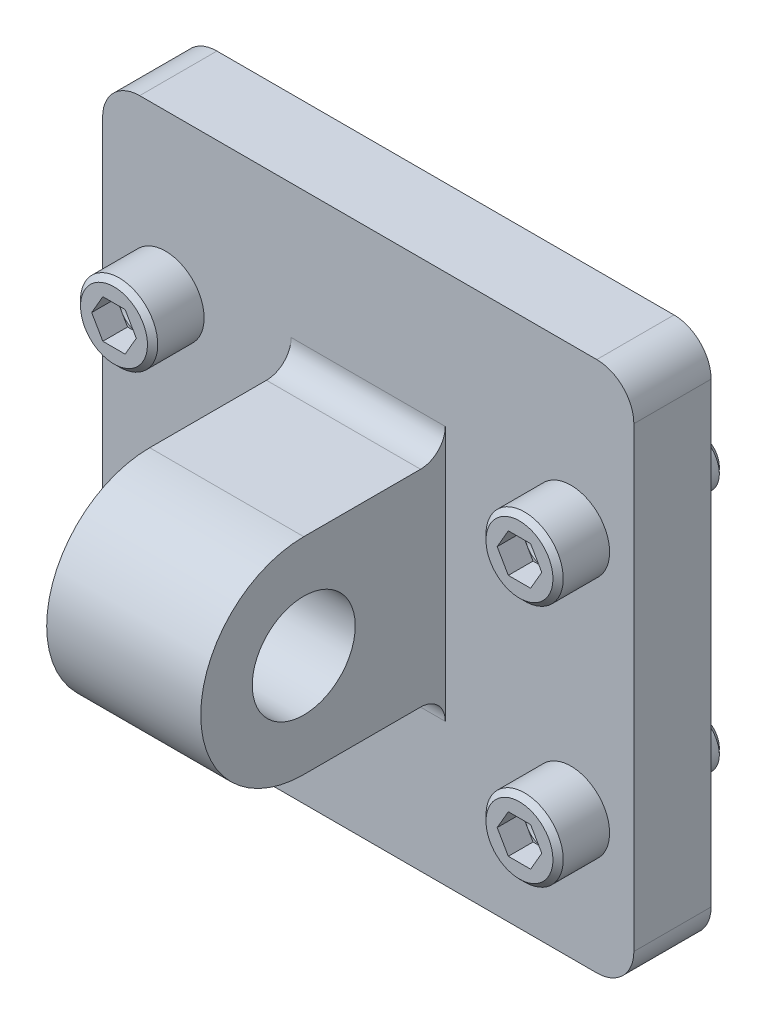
ISO-10303-21;
HEADER;
FILE_DESCRIPTION(('STEP AP214'),'2;1');
FILE_NAME('part.step','',(''),(''),'','','');
FILE_SCHEMA(('AUTOMOTIVE_DESIGN { 1 0 10303 214 1 1 1 1 }'));
ENDSEC;
DATA;
#1=APPLICATION_CONTEXT('core data for automotive mechanical design processes');
#2=APPLICATION_PROTOCOL_DEFINITION('international standard','automotive_design',2000,#1);
#3=PRODUCT_CONTEXT('',#1,'mechanical');
#4=PRODUCT('Part','Part','',(#3));
#5=PRODUCT_RELATED_PRODUCT_CATEGORY('part','',(#4));
#6=PRODUCT_DEFINITION_FORMATION('','',#4);
#7=PRODUCT_DEFINITION_CONTEXT('part definition',#1,'design');
#8=PRODUCT_DEFINITION('design','',#6,#7);
#9=PRODUCT_DEFINITION_SHAPE('','',#8);
#10=(LENGTH_UNIT() NAMED_UNIT(*) SI_UNIT(.MILLI.,.METRE.));
#11=(NAMED_UNIT(*) PLANE_ANGLE_UNIT() SI_UNIT($,.RADIAN.));
#12=(NAMED_UNIT(*) SI_UNIT($,.STERADIAN.) SOLID_ANGLE_UNIT());
#13=UNCERTAINTY_MEASURE_WITH_UNIT(LENGTH_MEASURE(1.E-05),#10,'distance_accuracy_value','');
#14=(GEOMETRIC_REPRESENTATION_CONTEXT(3) GLOBAL_UNCERTAINTY_ASSIGNED_CONTEXT((#13)) GLOBAL_UNIT_ASSIGNED_CONTEXT((#10,
#11,#12)) REPRESENTATION_CONTEXT('',''));
#15=CARTESIAN_POINT('',(0.,0.,0.));
#16=DIRECTION('',(0.,0.,1.));
#17=DIRECTION('',(1.,0.,0.));
#18=AXIS2_PLACEMENT_3D('',#15,#16,#17);
#19=CARTESIAN_POINT('',(25.,-17.018,12.827));
#20=DIRECTION('',(0.,0.,1.));
#21=DIRECTION('',(0.,-1.,0.));
#22=AXIS2_PLACEMENT_3D('',#19,#20,#21);
#23=CONICAL_SURFACE('',#22,2.38125,1.0471975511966);
#24=CARTESIAN_POINT('',(25.,-17.018,11.4521846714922));
#25=VERTEX_POINT('',#24);
#26=VERTEX_LOOP('',#25);
#27=FACE_BOUND('',#26,.T.);
#28=CARTESIAN_POINT('',(25.,-17.018,12.827));
#29=DIRECTION('',(0.,0.,1.));
#30=DIRECTION('',(0.,-1.,0.));
#31=AXIS2_PLACEMENT_3D('',#28,#29,#30);
#32=CIRCLE('',#31,2.38125);
#33=CARTESIAN_POINT('',(25.,-19.39925,12.827));
#34=VERTEX_POINT('',#33);
#35=CARTESIAN_POINT('',(27.0622229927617,-18.208625,12.827));
#36=VERTEX_POINT('',#35);
#37=EDGE_CURVE('E793',#34,#36,#32,.T.);
#38=ORIENTED_EDGE('',*,*,#37,.T.);
#39=CARTESIAN_POINT('',(27.0622229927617,-15.827375,12.827));
#40=VERTEX_POINT('',#39);
#41=EDGE_CURVE('E797',#36,#40,#32,.T.);
#42=ORIENTED_EDGE('',*,*,#41,.T.);
#43=CARTESIAN_POINT('',(25.,-14.63675,12.827));
#44=VERTEX_POINT('',#43);
#45=EDGE_CURVE('E2140',#40,#44,#32,.T.);
#46=ORIENTED_EDGE('',*,*,#45,.T.);
#47=CARTESIAN_POINT('',(22.9377770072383,-15.827375,12.827));
#48=VERTEX_POINT('',#47);
#49=EDGE_CURVE('E2137',#44,#48,#32,.T.);
#50=ORIENTED_EDGE('',*,*,#49,.T.);
#51=CARTESIAN_POINT('',(22.9377770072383,-18.208625,12.827));
#52=VERTEX_POINT('',#51);
#53=EDGE_CURVE('E2129',#48,#52,#32,.T.);
#54=ORIENTED_EDGE('',*,*,#53,.T.);
#55=EDGE_CURVE('E792',#52,#34,#32,.T.);
#56=ORIENTED_EDGE('',*,*,#55,.T.);
#57=EDGE_LOOP('',(#38,#42,#46,#50,#54,#56));
#58=FACE_BOUND('',#57,.T.);
#59=ADVANCED_FACE('F14',(#27,#58),#23,.F.);
#60=CARTESIAN_POINT('',(29.1244459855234,-14.63675,12.827));
#61=DIRECTION('',(0.,0.,-1.));
#62=DIRECTION('',(0.,1.,0.));
#63=AXIS2_PLACEMENT_3D('',#60,#61,#62);
#64=PLANE('',#63);
#65=DIRECTION('',(-0.5,0.866025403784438,0.));
#66=VECTOR('',#65,1.);
#67=CARTESIAN_POINT('',(27.7496306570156,-17.018,12.827));
#68=LINE('',#67,#66);
#69=CARTESIAN_POINT('',(26.3748153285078,-14.63675,12.827));
#70=VERTEX_POINT('',#69);
#71=EDGE_CURVE('E770',#40,#70,#68,.T.);
#72=ORIENTED_EDGE('',*,*,#71,.T.);
#73=DIRECTION('',(-1.,0.,0.));
#74=VECTOR('',#73,1.);
#75=CARTESIAN_POINT('',(26.3748153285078,-14.63675,12.827));
#76=LINE('',#75,#74);
#77=EDGE_CURVE('E30',#70,#44,#76,.T.);
#78=ORIENTED_EDGE('',*,*,#77,.T.);
#79=ORIENTED_EDGE('',*,*,#45,.F.);
#80=EDGE_LOOP('',(#72,#78,#79));
#81=FACE_BOUND('',#80,.T.);
#82=ADVANCED_FACE('F841',(#81),#64,.F.);
#83=CARTESIAN_POINT('',(23.6251846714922,-14.63675,12.827));
#84=VERTEX_POINT('',#83);
#85=EDGE_CURVE('E768',#44,#84,#76,.T.);
#86=ORIENTED_EDGE('',*,*,#85,.T.);
#87=DIRECTION('',(0.5,0.866025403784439,0.));
#88=VECTOR('',#87,1.);
#89=CARTESIAN_POINT('',(22.2503693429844,-17.018,12.827));
#90=LINE('',#89,#88);
#91=EDGE_CURVE('E764',#48,#84,#90,.T.);
#92=ORIENTED_EDGE('',*,*,#91,.F.);
#93=ORIENTED_EDGE('',*,*,#49,.F.);
#94=EDGE_LOOP('',(#86,#92,#93));
#95=FACE_BOUND('',#94,.T.);
#96=ADVANCED_FACE('F845',(#95),#64,.F.);
#97=CARTESIAN_POINT('',(22.2503693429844,-17.018,12.827));
#98=VERTEX_POINT('',#97);
#99=EDGE_CURVE('E765',#98,#48,#90,.T.);
#100=ORIENTED_EDGE('',*,*,#99,.F.);
#101=DIRECTION('',(-0.5,0.866025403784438,0.));
#102=VECTOR('',#101,1.);
#103=CARTESIAN_POINT('',(23.6251846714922,-19.39925,12.827));
#104=LINE('',#103,#102);
#105=EDGE_CURVE('E760',#52,#98,#104,.T.);
#106=ORIENTED_EDGE('',*,*,#105,.F.);
#107=ORIENTED_EDGE('',*,*,#53,.F.);
#108=EDGE_LOOP('',(#100,#106,#107));
#109=FACE_BOUND('',#108,.T.);
#110=ADVANCED_FACE('F876',(#109),#64,.F.);
#111=CARTESIAN_POINT('',(23.6251846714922,-19.39925,12.827));
#112=VERTEX_POINT('',#111);
#113=EDGE_CURVE('E761',#112,#52,#104,.T.);
#114=ORIENTED_EDGE('',*,*,#113,.F.);
#115=DIRECTION('',(1.,0.,0.));
#116=VECTOR('',#115,1.);
#117=CARTESIAN_POINT('',(23.6251846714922,-19.39925,12.827));
#118=LINE('',#117,#116);
#119=EDGE_CURVE('E757',#112,#34,#118,.T.);
#120=ORIENTED_EDGE('',*,*,#119,.T.);
#121=ORIENTED_EDGE('',*,*,#55,.F.);
#122=EDGE_LOOP('',(#114,#120,#121));
#123=FACE_BOUND('',#122,.T.);
#124=ADVANCED_FACE('F1961',(#123),#64,.F.);
#125=CARTESIAN_POINT('',(26.3748153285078,-19.39925,12.827));
#126=VERTEX_POINT('',#125);
#127=EDGE_CURVE('E756',#34,#126,#118,.T.);
#128=ORIENTED_EDGE('',*,*,#127,.T.);
#129=DIRECTION('',(-0.5,-0.866025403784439,0.));
#130=VECTOR('',#129,1.);
#131=CARTESIAN_POINT('',(27.7496306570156,-17.018,12.827));
#132=LINE('',#131,#130);
#133=EDGE_CURVE('E752',#36,#126,#132,.T.);
#134=ORIENTED_EDGE('',*,*,#133,.F.);
#135=ORIENTED_EDGE('',*,*,#37,.F.);
#136=EDGE_LOOP('',(#128,#134,#135));
#137=FACE_BOUND('',#136,.T.);
#138=ADVANCED_FACE('F1951',(#137),#64,.F.);
#139=CARTESIAN_POINT('',(27.7496306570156,-17.018,12.827));
#140=VERTEX_POINT('',#139);
#141=EDGE_CURVE('E753',#140,#36,#132,.T.);
#142=ORIENTED_EDGE('',*,*,#141,.F.);
#143=EDGE_CURVE('E771',#140,#40,#68,.T.);
#144=ORIENTED_EDGE('',*,*,#143,.T.);
#145=ORIENTED_EDGE('',*,*,#41,.F.);
#146=EDGE_LOOP('',(#142,#144,#145));
#147=FACE_BOUND('',#146,.T.);
#148=ADVANCED_FACE('F847',(#147),#64,.F.);
#149=CARTESIAN_POINT('',(27.7496306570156,-17.018,12.827));
#150=DIRECTION('',(0.866025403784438,0.5,0.));
#151=DIRECTION('',(0.5,-0.866025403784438,0.));
#152=AXIS2_PLACEMENT_3D('',#149,#150,#151);
#153=PLANE('',#152);
#154=DIRECTION('',(-0.5,0.866025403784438,0.));
#155=VECTOR('',#154,1.);
#156=CARTESIAN_POINT('',(27.7496306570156,-17.018,15.875));
#157=LINE('',#156,#155);
#158=CARTESIAN_POINT('',(27.7496306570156,-17.018,15.875));
#159=VERTEX_POINT('',#158);
#160=CARTESIAN_POINT('',(26.3748153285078,-14.63675,15.875));
#161=VERTEX_POINT('',#160);
#162=EDGE_CURVE('E749',#159,#161,#157,.T.);
#163=ORIENTED_EDGE('',*,*,#162,.T.);
#164=DIRECTION('',(0.,0.,1.));
#165=VECTOR('',#164,1.);
#166=CARTESIAN_POINT('',(26.3748153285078,-14.63675,12.827));
#167=LINE('',#166,#165);
#168=EDGE_CURVE('E777',#70,#161,#167,.T.);
#169=ORIENTED_EDGE('',*,*,#168,.F.);
#170=ORIENTED_EDGE('',*,*,#71,.F.);
#171=ORIENTED_EDGE('',*,*,#143,.F.);
#172=DIRECTION('',(0.,0.,1.));
#173=VECTOR('',#172,1.);
#174=CARTESIAN_POINT('',(27.7496306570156,-17.018,12.827));
#175=LINE('',#174,#173);
#176=EDGE_CURVE('E774',#140,#159,#175,.T.);
#177=ORIENTED_EDGE('',*,*,#176,.T.);
#178=EDGE_LOOP('',(#163,#169,#170,#171,#177));
#179=FACE_BOUND('',#178,.T.);
#180=ADVANCED_FACE('F870',(#179),#153,.F.);
#181=CARTESIAN_POINT('',(26.3748153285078,-14.63675,12.827));
#182=DIRECTION('',(0.,1.,0.));
#183=DIRECTION('',(1.,0.,0.));
#184=AXIS2_PLACEMENT_3D('',#181,#182,#183);
#185=PLANE('',#184);
#186=DIRECTION('',(-1.,0.,0.));
#187=VECTOR('',#186,1.);
#188=CARTESIAN_POINT('',(26.3748153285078,-14.63675,15.875));
#189=LINE('',#188,#187);
#190=CARTESIAN_POINT('',(23.6251846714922,-14.63675,15.875));
#191=VERTEX_POINT('',#190);
#192=EDGE_CURVE('E747',#161,#191,#189,.T.);
#193=ORIENTED_EDGE('',*,*,#192,.T.);
#194=DIRECTION('',(0.,0.,1.));
#195=VECTOR('',#194,1.);
#196=CARTESIAN_POINT('',(23.6251846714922,-14.63675,12.827));
#197=LINE('',#196,#195);
#198=EDGE_CURVE('E780',#84,#191,#197,.T.);
#199=ORIENTED_EDGE('',*,*,#198,.F.);
#200=ORIENTED_EDGE('',*,*,#85,.F.);
#201=ORIENTED_EDGE('',*,*,#77,.F.);
#202=ORIENTED_EDGE('',*,*,#168,.T.);
#203=EDGE_LOOP('',(#193,#199,#200,#201,#202));
#204=FACE_BOUND('',#203,.T.);
#205=ADVANCED_FACE('F866',(#204),#185,.F.);
#206=CARTESIAN_POINT('',(22.2503693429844,-17.018,12.827));
#207=DIRECTION('',(0.866025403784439,-0.5,0.));
#208=DIRECTION('',(-0.5,-0.86602540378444,0.));
#209=AXIS2_PLACEMENT_3D('',#206,#207,#208);
#210=PLANE('',#209);
#211=DIRECTION('',(0.5,0.866025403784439,0.));
#212=VECTOR('',#211,1.);
#213=CARTESIAN_POINT('',(22.2503693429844,-17.018,15.875));
#214=LINE('',#213,#212);
#215=CARTESIAN_POINT('',(22.2503693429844,-17.018,15.875));
#216=VERTEX_POINT('',#215);
#217=EDGE_CURVE('E744',#216,#191,#214,.T.);
#218=ORIENTED_EDGE('',*,*,#217,.F.);
#219=DIRECTION('',(0.,0.,1.));
#220=VECTOR('',#219,1.);
#221=CARTESIAN_POINT('',(22.2503693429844,-17.018,12.827));
#222=LINE('',#221,#220);
#223=EDGE_CURVE('E783',#98,#216,#222,.T.);
#224=ORIENTED_EDGE('',*,*,#223,.F.);
#225=ORIENTED_EDGE('',*,*,#99,.T.);
#226=ORIENTED_EDGE('',*,*,#91,.T.);
#227=ORIENTED_EDGE('',*,*,#198,.T.);
#228=EDGE_LOOP('',(#218,#224,#225,#226,#227));
#229=FACE_BOUND('',#228,.T.);
#230=ADVANCED_FACE('F862',(#229),#210,.T.);
#231=CARTESIAN_POINT('',(23.6251846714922,-19.39925,12.827));
#232=DIRECTION('',(0.866025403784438,0.5,0.));
#233=DIRECTION('',(0.5,-0.866025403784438,0.));
#234=AXIS2_PLACEMENT_3D('',#231,#232,#233);
#235=PLANE('',#234);
#236=DIRECTION('',(-0.5,0.866025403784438,0.));
#237=VECTOR('',#236,1.);
#238=CARTESIAN_POINT('',(23.6251846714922,-19.39925,15.875));
#239=LINE('',#238,#237);
#240=CARTESIAN_POINT('',(23.6251846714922,-19.39925,15.875));
#241=VERTEX_POINT('',#240);
#242=EDGE_CURVE('E741',#241,#216,#239,.T.);
#243=ORIENTED_EDGE('',*,*,#242,.F.);
#244=DIRECTION('',(0.,0.,1.));
#245=VECTOR('',#244,1.);
#246=CARTESIAN_POINT('',(23.6251846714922,-19.39925,12.827));
#247=LINE('',#246,#245);
#248=EDGE_CURVE('E786',#112,#241,#247,.T.);
#249=ORIENTED_EDGE('',*,*,#248,.F.);
#250=ORIENTED_EDGE('',*,*,#113,.T.);
#251=ORIENTED_EDGE('',*,*,#105,.T.);
#252=ORIENTED_EDGE('',*,*,#223,.T.);
#253=EDGE_LOOP('',(#243,#249,#250,#251,#252));
#254=FACE_BOUND('',#253,.T.);
#255=ADVANCED_FACE('F858',(#254),#235,.T.);
#256=CARTESIAN_POINT('',(23.6251846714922,-19.39925,12.827));
#257=DIRECTION('',(0.,-1.,0.));
#258=DIRECTION('',(-1.,0.,0.));
#259=AXIS2_PLACEMENT_3D('',#256,#257,#258);
#260=PLANE('',#259);
#261=DIRECTION('',(1.,0.,0.));
#262=VECTOR('',#261,1.);
#263=CARTESIAN_POINT('',(23.6251846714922,-19.39925,15.875));
#264=LINE('',#263,#262);
#265=CARTESIAN_POINT('',(26.3748153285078,-19.39925,15.875));
#266=VERTEX_POINT('',#265);
#267=EDGE_CURVE('E739',#241,#266,#264,.T.);
#268=ORIENTED_EDGE('',*,*,#267,.T.);
#269=DIRECTION('',(0.,0.,1.));
#270=VECTOR('',#269,1.);
#271=CARTESIAN_POINT('',(26.3748153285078,-19.39925,12.827));
#272=LINE('',#271,#270);
#273=EDGE_CURVE('E789',#126,#266,#272,.T.);
#274=ORIENTED_EDGE('',*,*,#273,.F.);
#275=ORIENTED_EDGE('',*,*,#127,.F.);
#276=ORIENTED_EDGE('',*,*,#119,.F.);
#277=ORIENTED_EDGE('',*,*,#248,.T.);
#278=EDGE_LOOP('',(#268,#274,#275,#276,#277));
#279=FACE_BOUND('',#278,.T.);
#280=ADVANCED_FACE('F854',(#279),#260,.F.);
#281=CARTESIAN_POINT('',(27.7496306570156,-17.018,12.827));
#282=DIRECTION('',(-0.866025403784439,0.5,0.));
#283=DIRECTION('',(0.5,0.86602540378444,0.));
#284=AXIS2_PLACEMENT_3D('',#281,#282,#283);
#285=PLANE('',#284);
#286=DIRECTION('',(-0.5,-0.866025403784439,0.));
#287=VECTOR('',#286,1.);
#288=CARTESIAN_POINT('',(27.7496306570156,-17.018,15.875));
#289=LINE('',#288,#287);
#290=EDGE_CURVE('E736',#159,#266,#289,.T.);
#291=ORIENTED_EDGE('',*,*,#290,.F.);
#292=ORIENTED_EDGE('',*,*,#176,.F.);
#293=ORIENTED_EDGE('',*,*,#141,.T.);
#294=ORIENTED_EDGE('',*,*,#133,.T.);
#295=ORIENTED_EDGE('',*,*,#273,.T.);
#296=EDGE_LOOP('',(#291,#292,#293,#294,#295));
#297=FACE_BOUND('',#296,.T.);
#298=ADVANCED_FACE('F850',(#297),#285,.T.);
#299=CARTESIAN_POINT('',(25.,-17.018,15.875));
#300=DIRECTION('',(0.,0.,1.));
#301=DIRECTION('',(0.,-1.,0.));
#302=AXIS2_PLACEMENT_3D('',#299,#300,#301);
#303=PLANE('',#302);
#304=ORIENTED_EDGE('',*,*,#290,.T.);
#305=ORIENTED_EDGE('',*,*,#267,.F.);
#306=ORIENTED_EDGE('',*,*,#242,.T.);
#307=ORIENTED_EDGE('',*,*,#217,.T.);
#308=ORIENTED_EDGE('',*,*,#192,.F.);
#309=ORIENTED_EDGE('',*,*,#162,.F.);
#310=EDGE_LOOP('',(#304,#305,#306,#307,#308,#309));
#311=FACE_BOUND('',#310,.T.);
#312=CARTESIAN_POINT('',(25.,-17.018,15.875));
#313=DIRECTION('',(0.,0.,1.));
#314=DIRECTION('',(0.,-1.,0.));
#315=AXIS2_PLACEMENT_3D('',#312,#313,#314);
#316=CIRCLE('',#315,4.1275);
#317=CARTESIAN_POINT('',(25.,-21.1455,15.875));
#318=VERTEX_POINT('',#317);
#319=EDGE_CURVE('E796',#318,#318,#316,.T.);
#320=ORIENTED_EDGE('',*,*,#319,.T.);
#321=EDGE_LOOP('',(#320));
#322=FACE_BOUND('',#321,.T.);
#323=ADVANCED_FACE('F853',(#311,#322),#303,.T.);
#324=CARTESIAN_POINT('',(25.,-17.018,15.875));
#325=DIRECTION('',(0.,0.,-1.));
#326=DIRECTION('',(0.,1.,0.));
#327=AXIS2_PLACEMENT_3D('',#324,#325,#326);
#328=CONICAL_SURFACE('',#327,4.1275,0.785398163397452);
#329=CARTESIAN_POINT('',(25.,-17.018,15.24));
#330=DIRECTION('',(0.,0.,1.));
#331=DIRECTION('',(0.,-1.,0.));
#332=AXIS2_PLACEMENT_3D('',#329,#330,#331);
#333=CIRCLE('',#332,4.7625);
#334=CARTESIAN_POINT('',(25.,-21.7805,15.24));
#335=VERTEX_POINT('',#334);
#336=EDGE_CURVE('E800',#335,#335,#333,.T.);
#337=ORIENTED_EDGE('',*,*,#336,.T.);
#338=EDGE_LOOP('',(#337));
#339=FACE_BOUND('',#338,.T.);
#340=ORIENTED_EDGE('',*,*,#319,.F.);
#341=EDGE_LOOP('',(#340));
#342=FACE_BOUND('',#341,.T.);
#343=ADVANCED_FACE('F1923',(#339,#342),#328,.T.);
#344=CARTESIAN_POINT('',(25.,-17.018,47.625));
#345=DIRECTION('',(0.,0.,1.));
#346=DIRECTION('',(0.,-1.,0.));
#347=AXIS2_PLACEMENT_3D('',#344,#345,#346);
#348=CYLINDRICAL_SURFACE('',#347,4.7625);
#349=CARTESIAN_POINT('',(25.,-17.018,9.525));
#350=DIRECTION('',(0.,0.,1.));
#351=DIRECTION('',(0.,-1.,0.));
#352=AXIS2_PLACEMENT_3D('',#349,#350,#351);
#353=CIRCLE('',#352,4.7625);
#354=CARTESIAN_POINT('',(25.,-21.7805,9.525));
#355=VERTEX_POINT('',#354);
#356=EDGE_CURVE('E803',#355,#355,#353,.T.);
#357=ORIENTED_EDGE('',*,*,#356,.T.);
#358=EDGE_LOOP('',(#357));
#359=FACE_BOUND('',#358,.T.);
#360=ORIENTED_EDGE('',*,*,#336,.F.);
#361=EDGE_LOOP('',(#360));
#362=FACE_BOUND('',#361,.T.);
#363=ADVANCED_FACE('F1104',(#359,#362),#348,.T.);
#364=CARTESIAN_POINT('',(29.7625,-17.018,9.525));
#365=DIRECTION('',(0.,0.,-1.));
#366=DIRECTION('',(0.,1.,0.));
#367=AXIS2_PLACEMENT_3D('',#364,#365,#366);
#368=PLANE('',#367);
#369=CARTESIAN_POINT('',(25.,-17.018,9.525));
#370=DIRECTION('',(0.,0.,-1.));
#371=DIRECTION('',(0.,1.,0.));
#372=AXIS2_PLACEMENT_3D('',#369,#370,#371);
#373=CIRCLE('',#372,3.5306);
#374=CARTESIAN_POINT('',(25.,-13.4874,9.525));
#375=VERTEX_POINT('',#374);
#376=EDGE_CURVE('E811',#375,#375,#373,.F.);
#377=ORIENTED_EDGE('',*,*,#376,.T.);
#378=EDGE_LOOP('',(#377));
#379=FACE_BOUND('',#378,.T.);
#380=CARTESIAN_POINT('',(25.,-17.018,9.525));
#381=DIRECTION('',(0.,0.,-1.));
#382=DIRECTION('',(-1.,0.,0.));
#383=AXIS2_PLACEMENT_3D('',#380,#381,#382);
#384=CIRCLE('',#383,3.5687);
#385=CARTESIAN_POINT('',(21.4313,-17.018,9.525));
#386=VERTEX_POINT('',#385);
#387=EDGE_CURVE('E9',#386,#386,#384,.T.);
#388=ORIENTED_EDGE('',*,*,#387,.T.);
#389=EDGE_LOOP('',(#388));
#390=FACE_BOUND('',#389,.T.);
#391=ADVANCED_FACE('F1011',(#379,#390),#368,.T.);
#392=CARTESIAN_POINT('',(27.41935,-17.018,-6.35));
#393=DIRECTION('',(0.,0.,-1.));
#394=DIRECTION('',(0.,1.,0.));
#395=AXIS2_PLACEMENT_3D('',#392,#393,#394);
#396=PLANE('',#395);
#397=CARTESIAN_POINT('',(25.,-17.018,-6.35));
#398=DIRECTION('',(0.,0.,1.));
#399=DIRECTION('',(0.,-1.,0.));
#400=AXIS2_PLACEMENT_3D('',#397,#398,#399);
#401=CIRCLE('',#400,2.41935);
#402=CARTESIAN_POINT('',(25.,-19.43735,-6.35));
#403=VERTEX_POINT('',#402);
#404=EDGE_CURVE('E809',#403,#403,#401,.T.);
#405=ORIENTED_EDGE('',*,*,#404,.F.);
#406=EDGE_LOOP('',(#405));
#407=FACE_BOUND('',#406,.T.);
#408=ADVANCED_FACE('F16',(#407),#396,.T.);
#409=CARTESIAN_POINT('',(25.,-17.018,-6.35));
#410=DIRECTION('',(0.,0.,1.));
#411=DIRECTION('',(0.,-1.,0.));
#412=AXIS2_PLACEMENT_3D('',#409,#410,#411);
#413=CONICAL_SURFACE('',#412,2.41935,0.785398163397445);
#414=CARTESIAN_POINT('',(25.,-17.018,-5.59435));
#415=DIRECTION('',(0.,0.,1.));
#416=DIRECTION('',(0.,-1.,0.));
#417=AXIS2_PLACEMENT_3D('',#414,#415,#416);
#418=CIRCLE('',#417,3.175);
#419=CARTESIAN_POINT('',(25.,-20.193,-5.59435));
#420=VERTEX_POINT('',#419);
#421=EDGE_CURVE('E806',#420,#420,#418,.T.);
#422=ORIENTED_EDGE('',*,*,#421,.F.);
#423=EDGE_LOOP('',(#422));
#424=FACE_BOUND('',#423,.T.);
#425=ORIENTED_EDGE('',*,*,#404,.T.);
#426=EDGE_LOOP('',(#425));
#427=FACE_BOUND('',#426,.T.);
#428=ADVANCED_FACE('F836',(#424,#427),#413,.T.);
#429=CARTESIAN_POINT('',(25.,-17.018,47.625));
#430=DIRECTION('',(0.,0.,1.));
#431=DIRECTION('',(0.,-1.,0.));
#432=AXIS2_PLACEMENT_3D('',#429,#430,#431);
#433=CYLINDRICAL_SURFACE('',#432,3.175);
#434=CARTESIAN_POINT('',(25.,-17.018,9.1694));
#435=DIRECTION('',(0.,0.,-1.));
#436=DIRECTION('',(0.,1.,0.));
#437=AXIS2_PLACEMENT_3D('',#434,#435,#436);
#438=CIRCLE('',#437,3.175);
#439=CARTESIAN_POINT('',(25.,-13.843,9.1694));
#440=VERTEX_POINT('',#439);
#441=EDGE_CURVE('E18',#440,#440,#438,.T.);
#442=ORIENTED_EDGE('',*,*,#441,.T.);
#443=EDGE_LOOP('',(#442));
#444=FACE_BOUND('',#443,.T.);
#445=ORIENTED_EDGE('',*,*,#421,.T.);
#446=EDGE_LOOP('',(#445));
#447=FACE_BOUND('',#446,.T.);
#448=ADVANCED_FACE('F818',(#444,#447),#433,.T.);
#449=CARTESIAN_POINT('',(25.,-17.018,9.1694));
#450=DIRECTION('',(0.,0.,-1.));
#451=DIRECTION('',(0.,1.,0.));
#452=AXIS2_PLACEMENT_3D('',#449,#450,#451);
#453=TOROIDAL_SURFACE('',#452,3.5306,0.3556);
#454=ORIENTED_EDGE('',*,*,#441,.F.);
#455=EDGE_LOOP('',(#454));
#456=FACE_BOUND('',#455,.T.);
#457=ORIENTED_EDGE('',*,*,#376,.F.);
#458=EDGE_LOOP('',(#457));
#459=FACE_BOUND('',#458,.T.);
#460=ADVANCED_FACE('F821',(#456,#459),#453,.F.);
#461=CARTESIAN_POINT('',(-27.41935,12.982,-6.35));
#462=DIRECTION('',(0.,0.,-1.));
#463=DIRECTION('',(0.,-1.,0.));
#464=AXIS2_PLACEMENT_3D('',#461,#462,#463);
#465=PLANE('',#464);
#466=CARTESIAN_POINT('',(-25.,12.982,-6.35));
#467=DIRECTION('',(0.,0.,1.));
#468=DIRECTION('',(0.,1.,0.));
#469=AXIS2_PLACEMENT_3D('',#466,#467,#468);
#470=CIRCLE('',#469,2.41935);
#471=CARTESIAN_POINT('',(-25.,15.40135,-6.35));
#472=VERTEX_POINT('',#471);
#473=EDGE_CURVE('E584',#472,#472,#470,.T.);
#474=ORIENTED_EDGE('',*,*,#473,.F.);
#475=EDGE_LOOP('',(#474));
#476=FACE_BOUND('',#475,.T.);
#477=ADVANCED_FACE('F824',(#476),#465,.T.);
#478=CARTESIAN_POINT('',(-27.41935,-17.018,-6.35));
#479=DIRECTION('',(0.,0.,-1.));
#480=DIRECTION('',(0.,-1.,0.));
#481=AXIS2_PLACEMENT_3D('',#478,#479,#480);
#482=PLANE('',#481);
#483=CARTESIAN_POINT('',(-25.,-17.018,-6.35));
#484=DIRECTION('',(0.,0.,1.));
#485=DIRECTION('',(0.,1.,0.));
#486=AXIS2_PLACEMENT_3D('',#483,#484,#485);
#487=CIRCLE('',#486,2.41935);
#488=CARTESIAN_POINT('',(-25.,-14.59865,-6.35));
#489=VERTEX_POINT('',#488);
#490=EDGE_CURVE('E504',#489,#489,#487,.T.);
#491=ORIENTED_EDGE('',*,*,#490,.F.);
#492=EDGE_LOOP('',(#491));
#493=FACE_BOUND('',#492,.T.);
#494=ADVANCED_FACE('F831',(#493),#482,.T.);
#495=CARTESIAN_POINT('',(22.58065,12.982,-6.35));
#496=DIRECTION('',(0.,0.,-1.));
#497=DIRECTION('',(0.,-1.,0.));
#498=AXIS2_PLACEMENT_3D('',#495,#496,#497);
#499=PLANE('',#498);
#500=CARTESIAN_POINT('',(25.,12.982,-6.35));
#501=DIRECTION('',(0.,0.,1.));
#502=DIRECTION('',(0.,1.,0.));
#503=AXIS2_PLACEMENT_3D('',#500,#501,#502);
#504=CIRCLE('',#503,2.41935);
#505=CARTESIAN_POINT('',(25.,15.40135,-6.35));
#506=VERTEX_POINT('',#505);
#507=EDGE_CURVE('E424',#506,#506,#504,.T.);
#508=ORIENTED_EDGE('',*,*,#507,.F.);
#509=EDGE_LOOP('',(#508));
#510=FACE_BOUND('',#509,.T.);
#511=ADVANCED_FACE('F976',(#510),#499,.T.);
#512=CARTESIAN_POINT('',(-25.,12.982,-6.35));
#513=DIRECTION('',(0.,0.,1.));
#514=DIRECTION('',(0.,1.,0.));
#515=AXIS2_PLACEMENT_3D('',#512,#513,#514);
#516=CONICAL_SURFACE('',#515,2.41935,0.785398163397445);
#517=CARTESIAN_POINT('',(-25.,12.982,-5.59435));
#518=DIRECTION('',(0.,0.,1.));
#519=DIRECTION('',(0.,1.,0.));
#520=AXIS2_PLACEMENT_3D('',#517,#518,#519);
#521=CIRCLE('',#520,3.175);
#522=CARTESIAN_POINT('',(-25.,16.157,-5.59435));
#523=VERTEX_POINT('',#522);
#524=EDGE_CURVE('E581',#523,#523,#521,.T.);
#525=ORIENTED_EDGE('',*,*,#524,.F.);
#526=EDGE_LOOP('',(#525));
#527=FACE_BOUND('',#526,.T.);
#528=ORIENTED_EDGE('',*,*,#473,.T.);
#529=EDGE_LOOP('',(#528));
#530=FACE_BOUND('',#529,.T.);
#531=ADVANCED_FACE('F835',(#527,#530),#516,.T.);
#532=CARTESIAN_POINT('',(-25.,-17.018,-6.35));
#533=DIRECTION('',(0.,0.,1.));
#534=DIRECTION('',(0.,1.,0.));
#535=AXIS2_PLACEMENT_3D('',#532,#533,#534);
#536=CONICAL_SURFACE('',#535,2.41935,0.785398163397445);
#537=CARTESIAN_POINT('',(-25.,-17.018,-5.59435));
#538=DIRECTION('',(0.,0.,1.));
#539=DIRECTION('',(0.,1.,0.));
#540=AXIS2_PLACEMENT_3D('',#537,#538,#539);
#541=CIRCLE('',#540,3.175);
#542=CARTESIAN_POINT('',(-25.,-13.843,-5.59435));
#543=VERTEX_POINT('',#542);
#544=EDGE_CURVE('E501',#543,#543,#541,.T.);
#545=ORIENTED_EDGE('',*,*,#544,.F.);
#546=EDGE_LOOP('',(#545));
#547=FACE_BOUND('',#546,.T.);
#548=ORIENTED_EDGE('',*,*,#490,.T.);
#549=EDGE_LOOP('',(#548));
#550=FACE_BOUND('',#549,.T.);
#551=ADVANCED_FACE('F975',(#547,#550),#536,.T.);
#552=CARTESIAN_POINT('',(25.,12.982,-6.35));
#553=DIRECTION('',(0.,0.,1.));
#554=DIRECTION('',(0.,1.,0.));
#555=AXIS2_PLACEMENT_3D('',#552,#553,#554);
#556=CONICAL_SURFACE('',#555,2.41935,0.785398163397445);
#557=CARTESIAN_POINT('',(25.,12.982,-5.59435));
#558=DIRECTION('',(0.,0.,1.));
#559=DIRECTION('',(0.,1.,0.));
#560=AXIS2_PLACEMENT_3D('',#557,#558,#559);
#561=CIRCLE('',#560,3.175);
#562=CARTESIAN_POINT('',(25.,16.157,-5.59435));
#563=VERTEX_POINT('',#562);
#564=EDGE_CURVE('E421',#563,#563,#561,.T.);
#565=ORIENTED_EDGE('',*,*,#564,.F.);
#566=EDGE_LOOP('',(#565));
#567=FACE_BOUND('',#566,.T.);
#568=ORIENTED_EDGE('',*,*,#507,.T.);
#569=EDGE_LOOP('',(#568));
#570=FACE_BOUND('',#569,.T.);
#571=ADVANCED_FACE('F1047',(#567,#570),#556,.T.);
#572=CARTESIAN_POINT('',(25.,12.982,12.827));
#573=DIRECTION('',(0.,0.,1.));
#574=DIRECTION('',(0.,1.,0.));
#575=AXIS2_PLACEMENT_3D('',#572,#573,#574);
#576=CONICAL_SURFACE('',#575,2.38125,1.0471975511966);
#577=CARTESIAN_POINT('',(25.,12.982,11.4521846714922));
#578=VERTEX_POINT('',#577);
#579=VERTEX_LOOP('',#578);
#580=FACE_BOUND('',#579,.T.);
#581=CARTESIAN_POINT('',(25.,12.982,12.827));
#582=DIRECTION('',(0.,0.,1.));
#583=DIRECTION('',(0.,1.,0.));
#584=AXIS2_PLACEMENT_3D('',#581,#582,#583);
#585=CIRCLE('',#584,2.38125);
#586=CARTESIAN_POINT('',(25.,15.36325,12.827));
#587=VERTEX_POINT('',#586);
#588=CARTESIAN_POINT('',(22.9377770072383,14.172625,12.827));
#589=VERTEX_POINT('',#588);
#590=EDGE_CURVE('E411',#587,#589,#585,.T.);
#591=ORIENTED_EDGE('',*,*,#590,.T.);
#592=CARTESIAN_POINT('',(22.9377770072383,11.791375,12.827));
#593=VERTEX_POINT('',#592);
#594=EDGE_CURVE('E415',#589,#593,#585,.T.);
#595=ORIENTED_EDGE('',*,*,#594,.T.);
#596=CARTESIAN_POINT('',(25.,10.60075,12.827));
#597=VERTEX_POINT('',#596);
#598=EDGE_CURVE('E1179',#593,#597,#585,.T.);
#599=ORIENTED_EDGE('',*,*,#598,.T.);
#600=CARTESIAN_POINT('',(27.0622229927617,11.791375,12.827));
#601=VERTEX_POINT('',#600);
#602=EDGE_CURVE('E1166',#597,#601,#585,.T.);
#603=ORIENTED_EDGE('',*,*,#602,.T.);
#604=CARTESIAN_POINT('',(27.0622229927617,14.172625,12.827));
#605=VERTEX_POINT('',#604);
#606=EDGE_CURVE('E1187',#601,#605,#585,.T.);
#607=ORIENTED_EDGE('',*,*,#606,.T.);
#608=EDGE_CURVE('E362',#605,#587,#585,.T.);
#609=ORIENTED_EDGE('',*,*,#608,.T.);
#610=EDGE_LOOP('',(#591,#595,#599,#603,#607,#609));
#611=FACE_BOUND('',#610,.T.);
#612=ADVANCED_FACE('F990',(#580,#611),#576,.F.);
#613=CARTESIAN_POINT('',(-25.,-17.018,12.827));
#614=DIRECTION('',(0.,0.,1.));
#615=DIRECTION('',(0.,1.,0.));
#616=AXIS2_PLACEMENT_3D('',#613,#614,#615);
#617=CONICAL_SURFACE('',#616,2.38125,1.0471975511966);
#618=CARTESIAN_POINT('',(-25.,-17.018,11.4521846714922));
#619=VERTEX_POINT('',#618);
#620=VERTEX_LOOP('',#619);
#621=FACE_BOUND('',#620,.T.);
#622=CARTESIAN_POINT('',(-25.,-17.018,12.827));
#623=DIRECTION('',(0.,0.,1.));
#624=DIRECTION('',(0.,1.,0.));
#625=AXIS2_PLACEMENT_3D('',#622,#623,#624);
#626=CIRCLE('',#625,2.38125);
#627=CARTESIAN_POINT('',(-25.,-14.63675,12.827));
#628=VERTEX_POINT('',#627);
#629=CARTESIAN_POINT('',(-27.0622229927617,-15.827375,12.827));
#630=VERTEX_POINT('',#629);
#631=EDGE_CURVE('E491',#628,#630,#626,.T.);
#632=ORIENTED_EDGE('',*,*,#631,.T.);
#633=CARTESIAN_POINT('',(-27.0622229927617,-18.208625,12.827));
#634=VERTEX_POINT('',#633);
#635=EDGE_CURVE('E495',#630,#634,#626,.T.);
#636=ORIENTED_EDGE('',*,*,#635,.T.);
#637=CARTESIAN_POINT('',(-25.,-19.39925,12.827));
#638=VERTEX_POINT('',#637);
#639=EDGE_CURVE('E1223',#634,#638,#626,.T.);
#640=ORIENTED_EDGE('',*,*,#639,.T.);
#641=CARTESIAN_POINT('',(-22.9377770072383,-18.208625,12.827));
#642=VERTEX_POINT('',#641);
#643=EDGE_CURVE('E1226',#638,#642,#626,.T.);
#644=ORIENTED_EDGE('',*,*,#643,.T.);
#645=CARTESIAN_POINT('',(-22.9377770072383,-15.827375,12.827));
#646=VERTEX_POINT('',#645);
#647=EDGE_CURVE('E1227',#642,#646,#626,.T.);
#648=ORIENTED_EDGE('',*,*,#647,.T.);
#649=EDGE_CURVE('E490',#646,#628,#626,.T.);
#650=ORIENTED_EDGE('',*,*,#649,.T.);
#651=EDGE_LOOP('',(#632,#636,#640,#644,#648,#650));
#652=FACE_BOUND('',#651,.T.);
#653=ADVANCED_FACE('F1003',(#621,#652),#617,.F.);
#654=CARTESIAN_POINT('',(-25.,12.982,12.827));
#655=DIRECTION('',(0.,0.,1.));
#656=DIRECTION('',(0.,1.,0.));
#657=AXIS2_PLACEMENT_3D('',#654,#655,#656);
#658=CONICAL_SURFACE('',#657,2.38125,1.0471975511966);
#659=CARTESIAN_POINT('',(-25.,12.982,11.4521846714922));
#660=VERTEX_POINT('',#659);
#661=VERTEX_LOOP('',#660);
#662=FACE_BOUND('',#661,.T.);
#663=CARTESIAN_POINT('',(-25.,12.982,12.827));
#664=DIRECTION('',(0.,0.,1.));
#665=DIRECTION('',(0.,1.,0.));
#666=AXIS2_PLACEMENT_3D('',#663,#664,#665);
#667=CIRCLE('',#666,2.38125);
#668=CARTESIAN_POINT('',(-25.,15.36325,12.827));
#669=VERTEX_POINT('',#668);
#670=CARTESIAN_POINT('',(-27.0622229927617,14.172625,12.827));
#671=VERTEX_POINT('',#670);
#672=EDGE_CURVE('E571',#669,#671,#667,.T.);
#673=ORIENTED_EDGE('',*,*,#672,.T.);
#674=CARTESIAN_POINT('',(-27.0622229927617,11.791375,12.827));
#675=VERTEX_POINT('',#674);
#676=EDGE_CURVE('E575',#671,#675,#667,.T.);
#677=ORIENTED_EDGE('',*,*,#676,.T.);
#678=CARTESIAN_POINT('',(-25.,10.60075,12.827));
#679=VERTEX_POINT('',#678);
#680=EDGE_CURVE('E2236',#675,#679,#667,.T.);
#681=ORIENTED_EDGE('',*,*,#680,.T.);
#682=CARTESIAN_POINT('',(-22.9377770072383,11.791375,12.827));
#683=VERTEX_POINT('',#682);
#684=EDGE_CURVE('E2239',#679,#683,#667,.T.);
#685=ORIENTED_EDGE('',*,*,#684,.T.);
#686=CARTESIAN_POINT('',(-22.9377770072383,14.172625,12.827));
#687=VERTEX_POINT('',#686);
#688=EDGE_CURVE('E2240',#683,#687,#667,.T.);
#689=ORIENTED_EDGE('',*,*,#688,.T.);
#690=EDGE_CURVE('E570',#687,#669,#667,.T.);
#691=ORIENTED_EDGE('',*,*,#690,.T.);
#692=EDGE_LOOP('',(#673,#677,#681,#685,#689,#691));
#693=FACE_BOUND('',#692,.T.);
#694=ADVANCED_FACE('F982',(#662,#693),#658,.F.);
#695=CARTESIAN_POINT('',(-25.,12.982,47.625));
#696=DIRECTION('',(0.,0.,1.));
#697=DIRECTION('',(0.,1.,0.));
#698=AXIS2_PLACEMENT_3D('',#695,#696,#697);
#699=CYLINDRICAL_SURFACE('',#698,3.175);
#700=CARTESIAN_POINT('',(-25.,12.982,9.1694));
#701=DIRECTION('',(0.,0.,-1.));
#702=DIRECTION('',(0.,-1.,0.));
#703=AXIS2_PLACEMENT_3D('',#700,#701,#702);
#704=CIRCLE('',#703,3.175);
#705=CARTESIAN_POINT('',(-25.,9.807,9.1694));
#706=VERTEX_POINT('',#705);
#707=EDGE_CURVE('E590',#706,#706,#704,.T.);
#708=ORIENTED_EDGE('',*,*,#707,.T.);
#709=EDGE_LOOP('',(#708));
#710=FACE_BOUND('',#709,.T.);
#711=ORIENTED_EDGE('',*,*,#524,.T.);
#712=EDGE_LOOP('',(#711));
#713=FACE_BOUND('',#712,.T.);
#714=ADVANCED_FACE('F978',(#710,#713),#699,.T.);
#715=CARTESIAN_POINT('',(-25.,-17.018,47.625));
#716=DIRECTION('',(0.,0.,1.));
#717=DIRECTION('',(0.,1.,0.));
#718=AXIS2_PLACEMENT_3D('',#715,#716,#717);
#719=CYLINDRICAL_SURFACE('',#718,3.175);
#720=CARTESIAN_POINT('',(-25.,-17.018,9.1694));
#721=DIRECTION('',(0.,0.,-1.));
#722=DIRECTION('',(0.,-1.,0.));
#723=AXIS2_PLACEMENT_3D('',#720,#721,#722);
#724=CIRCLE('',#723,3.175);
#725=CARTESIAN_POINT('',(-25.,-20.193,9.1694));
#726=VERTEX_POINT('',#725);
#727=EDGE_CURVE('E510',#726,#726,#724,.T.);
#728=ORIENTED_EDGE('',*,*,#727,.T.);
#729=EDGE_LOOP('',(#728));
#730=FACE_BOUND('',#729,.T.);
#731=ORIENTED_EDGE('',*,*,#544,.T.);
#732=EDGE_LOOP('',(#731));
#733=FACE_BOUND('',#732,.T.);
#734=ADVANCED_FACE('F981',(#730,#733),#719,.T.);
#735=CARTESIAN_POINT('',(25.,12.982,47.625));
#736=DIRECTION('',(0.,0.,1.));
#737=DIRECTION('',(0.,1.,0.));
#738=AXIS2_PLACEMENT_3D('',#735,#736,#737);
#739=CYLINDRICAL_SURFACE('',#738,3.175);
#740=CARTESIAN_POINT('',(25.,12.982,9.1694));
#741=DIRECTION('',(0.,0.,-1.));
#742=DIRECTION('',(0.,-1.,0.));
#743=AXIS2_PLACEMENT_3D('',#740,#741,#742);
#744=CIRCLE('',#743,3.175);
#745=CARTESIAN_POINT('',(25.,9.807,9.1694));
#746=VERTEX_POINT('',#745);
#747=EDGE_CURVE('E430',#746,#746,#744,.T.);
#748=ORIENTED_EDGE('',*,*,#747,.T.);
#749=EDGE_LOOP('',(#748));
#750=FACE_BOUND('',#749,.T.);
#751=ORIENTED_EDGE('',*,*,#564,.T.);
#752=EDGE_LOOP('',(#751));
#753=FACE_BOUND('',#752,.T.);
#754=ADVANCED_FACE('F1051',(#750,#753),#739,.T.);
#755=CARTESIAN_POINT('',(20.8755540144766,10.60075,12.827));
#756=DIRECTION('',(0.,0.,-1.));
#757=DIRECTION('',(0.,-1.,0.));
#758=AXIS2_PLACEMENT_3D('',#755,#756,#757);
#759=PLANE('',#758);
#760=DIRECTION('',(0.5,-0.866025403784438,0.));
#761=VECTOR('',#760,1.);
#762=CARTESIAN_POINT('',(22.2503693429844,12.982,12.827));
#763=LINE('',#762,#761);
#764=CARTESIAN_POINT('',(23.6251846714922,10.60075,12.827));
#765=VERTEX_POINT('',#764);
#766=EDGE_CURVE('E395',#593,#765,#763,.T.);
#767=ORIENTED_EDGE('',*,*,#766,.T.);
#768=DIRECTION('',(1.,0.,0.));
#769=VECTOR('',#768,1.);
#770=CARTESIAN_POINT('',(23.6251846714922,10.60075,12.827));
#771=LINE('',#770,#769);
#772=EDGE_CURVE('E393',#765,#597,#771,.T.);
#773=ORIENTED_EDGE('',*,*,#772,.T.);
#774=ORIENTED_EDGE('',*,*,#598,.F.);
#775=EDGE_LOOP('',(#767,#773,#774));
#776=FACE_BOUND('',#775,.T.);
#777=ADVANCED_FACE('F1110',(#776),#759,.F.);
#778=CARTESIAN_POINT('',(26.3748153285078,10.60075,12.827));
#779=VERTEX_POINT('',#778);
#780=EDGE_CURVE('E392',#597,#779,#771,.T.);
#781=ORIENTED_EDGE('',*,*,#780,.T.);
#782=DIRECTION('',(-0.5,-0.866025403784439,0.));
#783=VECTOR('',#782,1.);
#784=CARTESIAN_POINT('',(27.7496306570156,12.982,12.827));
#785=LINE('',#784,#783);
#786=EDGE_CURVE('E388',#601,#779,#785,.T.);
#787=ORIENTED_EDGE('',*,*,#786,.F.);
#788=ORIENTED_EDGE('',*,*,#602,.F.);
#789=EDGE_LOOP('',(#781,#787,#788));
#790=FACE_BOUND('',#789,.T.);
#791=ADVANCED_FACE('F1149',(#790),#759,.F.);
#792=CARTESIAN_POINT('',(27.7496306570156,12.982,12.827));
#793=VERTEX_POINT('',#792);
#794=EDGE_CURVE('E389',#793,#601,#785,.T.);
#795=ORIENTED_EDGE('',*,*,#794,.F.);
#796=DIRECTION('',(0.5,-0.866025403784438,0.));
#797=VECTOR('',#796,1.);
#798=CARTESIAN_POINT('',(26.3748153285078,15.36325,12.827));
#799=LINE('',#798,#797);
#800=EDGE_CURVE('E384',#605,#793,#799,.T.);
#801=ORIENTED_EDGE('',*,*,#800,.F.);
#802=ORIENTED_EDGE('',*,*,#606,.F.);
#803=EDGE_LOOP('',(#795,#801,#802));
#804=FACE_BOUND('',#803,.T.);
#805=ADVANCED_FACE('F1151',(#804),#759,.F.);
#806=CARTESIAN_POINT('',(26.3748153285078,15.36325,12.827));
#807=VERTEX_POINT('',#806);
#808=EDGE_CURVE('E385',#807,#605,#799,.T.);
#809=ORIENTED_EDGE('',*,*,#808,.F.);
#810=DIRECTION('',(-1.,0.,0.));
#811=VECTOR('',#810,1.);
#812=CARTESIAN_POINT('',(26.3748153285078,15.36325,12.827));
#813=LINE('',#812,#811);
#814=EDGE_CURVE('E381',#807,#587,#813,.T.);
#815=ORIENTED_EDGE('',*,*,#814,.T.);
#816=ORIENTED_EDGE('',*,*,#608,.F.);
#817=EDGE_LOOP('',(#809,#815,#816));
#818=FACE_BOUND('',#817,.T.);
#819=ADVANCED_FACE('F1157',(#818),#759,.F.);
#820=CARTESIAN_POINT('',(23.6251846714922,15.36325,12.827));
#821=VERTEX_POINT('',#820);
#822=EDGE_CURVE('E380',#587,#821,#813,.T.);
#823=ORIENTED_EDGE('',*,*,#822,.T.);
#824=DIRECTION('',(0.5,0.866025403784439,0.));
#825=VECTOR('',#824,1.);
#826=CARTESIAN_POINT('',(22.2503693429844,12.982,12.827));
#827=LINE('',#826,#825);
#828=EDGE_CURVE('E361',#589,#821,#827,.T.);
#829=ORIENTED_EDGE('',*,*,#828,.F.);
#830=ORIENTED_EDGE('',*,*,#590,.F.);
#831=EDGE_LOOP('',(#823,#829,#830));
#832=FACE_BOUND('',#831,.T.);
#833=ADVANCED_FACE('F1181',(#832),#759,.F.);
#834=CARTESIAN_POINT('',(22.2503693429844,12.982,12.827));
#835=VERTEX_POINT('',#834);
#836=EDGE_CURVE('E378',#835,#589,#827,.T.);
#837=ORIENTED_EDGE('',*,*,#836,.F.);
#838=EDGE_CURVE('E396',#835,#593,#763,.T.);
#839=ORIENTED_EDGE('',*,*,#838,.T.);
#840=ORIENTED_EDGE('',*,*,#594,.F.);
#841=EDGE_LOOP('',(#837,#839,#840));
#842=FACE_BOUND('',#841,.T.);
#843=ADVANCED_FACE('F1160',(#842),#759,.F.);
#844=CARTESIAN_POINT('',(-29.1244459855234,-19.39925,12.827));
#845=DIRECTION('',(0.,0.,-1.));
#846=DIRECTION('',(0.,-1.,0.));
#847=AXIS2_PLACEMENT_3D('',#844,#845,#846);
#848=PLANE('',#847);
#849=DIRECTION('',(0.5,-0.866025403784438,0.));
#850=VECTOR('',#849,1.);
#851=CARTESIAN_POINT('',(-27.7496306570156,-17.018,12.827));
#852=LINE('',#851,#850);
#853=CARTESIAN_POINT('',(-26.3748153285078,-19.39925,12.827));
#854=VERTEX_POINT('',#853);
#855=EDGE_CURVE('E468',#634,#854,#852,.T.);
#856=ORIENTED_EDGE('',*,*,#855,.T.);
#857=DIRECTION('',(1.,0.,0.));
#858=VECTOR('',#857,1.);
#859=CARTESIAN_POINT('',(-26.3748153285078,-19.39925,12.827));
#860=LINE('',#859,#858);
#861=EDGE_CURVE('E466',#854,#638,#860,.T.);
#862=ORIENTED_EDGE('',*,*,#861,.T.);
#863=ORIENTED_EDGE('',*,*,#639,.F.);
#864=EDGE_LOOP('',(#856,#862,#863));
#865=FACE_BOUND('',#864,.T.);
#866=ADVANCED_FACE('F1072',(#865),#848,.F.);
#867=CARTESIAN_POINT('',(-23.6251846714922,-19.39925,12.827));
#868=VERTEX_POINT('',#867);
#869=EDGE_CURVE('E465',#638,#868,#860,.T.);
#870=ORIENTED_EDGE('',*,*,#869,.T.);
#871=DIRECTION('',(-0.5,-0.866025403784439,0.));
#872=VECTOR('',#871,1.);
#873=CARTESIAN_POINT('',(-22.2503693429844,-17.018,12.827));
#874=LINE('',#873,#872);
#875=EDGE_CURVE('E461',#642,#868,#874,.T.);
#876=ORIENTED_EDGE('',*,*,#875,.F.);
#877=ORIENTED_EDGE('',*,*,#643,.F.);
#878=EDGE_LOOP('',(#870,#876,#877));
#879=FACE_BOUND('',#878,.T.);
#880=ADVANCED_FACE('F1096',(#879),#848,.F.);
#881=CARTESIAN_POINT('',(-22.2503693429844,-17.018,12.827));
#882=VERTEX_POINT('',#881);
#883=EDGE_CURVE('E462',#882,#642,#874,.T.);
#884=ORIENTED_EDGE('',*,*,#883,.F.);
#885=DIRECTION('',(0.5,-0.866025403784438,0.));
#886=VECTOR('',#885,1.);
#887=CARTESIAN_POINT('',(-23.6251846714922,-14.63675,12.827));
#888=LINE('',#887,#886);
#889=EDGE_CURVE('E457',#646,#882,#888,.T.);
#890=ORIENTED_EDGE('',*,*,#889,.F.);
#891=ORIENTED_EDGE('',*,*,#647,.F.);
#892=EDGE_LOOP('',(#884,#890,#891));
#893=FACE_BOUND('',#892,.T.);
#894=ADVANCED_FACE('F1099',(#893),#848,.F.);
#895=CARTESIAN_POINT('',(-23.6251846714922,-14.63675,12.827));
#896=VERTEX_POINT('',#895);
#897=EDGE_CURVE('E458',#896,#646,#888,.T.);
#898=ORIENTED_EDGE('',*,*,#897,.F.);
#899=DIRECTION('',(-1.,0.,0.));
#900=VECTOR('',#899,1.);
#901=CARTESIAN_POINT('',(-23.6251846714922,-14.63675,12.827));
#902=LINE('',#901,#900);
#903=EDGE_CURVE('E454',#896,#628,#902,.T.);
#904=ORIENTED_EDGE('',*,*,#903,.T.);
#905=ORIENTED_EDGE('',*,*,#649,.F.);
#906=EDGE_LOOP('',(#898,#904,#905));
#907=FACE_BOUND('',#906,.T.);
#908=ADVANCED_FACE('F1210',(#907),#848,.F.);
#909=CARTESIAN_POINT('',(-26.3748153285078,-14.63675,12.827));
#910=VERTEX_POINT('',#909);
#911=EDGE_CURVE('E453',#628,#910,#902,.T.);
#912=ORIENTED_EDGE('',*,*,#911,.T.);
#913=DIRECTION('',(0.5,0.866025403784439,0.));
#914=VECTOR('',#913,1.);
#915=CARTESIAN_POINT('',(-27.7496306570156,-17.018,12.827));
#916=LINE('',#915,#914);
#917=EDGE_CURVE('E449',#630,#910,#916,.T.);
#918=ORIENTED_EDGE('',*,*,#917,.F.);
#919=ORIENTED_EDGE('',*,*,#631,.F.);
#920=EDGE_LOOP('',(#912,#918,#919));
#921=FACE_BOUND('',#920,.T.);
#922=ADVANCED_FACE('F1203',(#921),#848,.F.);
#923=CARTESIAN_POINT('',(-27.7496306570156,-17.018,12.827));
#924=VERTEX_POINT('',#923);
#925=EDGE_CURVE('E450',#924,#630,#916,.T.);
#926=ORIENTED_EDGE('',*,*,#925,.F.);
#927=EDGE_CURVE('E469',#924,#634,#852,.T.);
#928=ORIENTED_EDGE('',*,*,#927,.T.);
#929=ORIENTED_EDGE('',*,*,#635,.F.);
#930=EDGE_LOOP('',(#926,#928,#929));
#931=FACE_BOUND('',#930,.T.);
#932=ADVANCED_FACE('F1199',(#931),#848,.F.);
#933=CARTESIAN_POINT('',(-29.1244459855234,10.60075,12.827));
#934=DIRECTION('',(0.,0.,-1.));
#935=DIRECTION('',(0.,-1.,0.));
#936=AXIS2_PLACEMENT_3D('',#933,#934,#935);
#937=PLANE('',#936);
#938=DIRECTION('',(0.5,-0.866025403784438,0.));
#939=VECTOR('',#938,1.);
#940=CARTESIAN_POINT('',(-27.7496306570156,12.982,12.827));
#941=LINE('',#940,#939);
#942=CARTESIAN_POINT('',(-26.3748153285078,10.60075,12.827));
#943=VERTEX_POINT('',#942);
#944=EDGE_CURVE('E548',#675,#943,#941,.T.);
#945=ORIENTED_EDGE('',*,*,#944,.T.);
#946=DIRECTION('',(1.,0.,0.));
#947=VECTOR('',#946,1.);
#948=CARTESIAN_POINT('',(-26.3748153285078,10.60075,12.827));
#949=LINE('',#948,#947);
#950=EDGE_CURVE('E546',#943,#679,#949,.T.);
#951=ORIENTED_EDGE('',*,*,#950,.T.);
#952=ORIENTED_EDGE('',*,*,#680,.F.);
#953=EDGE_LOOP('',(#945,#951,#952));
#954=FACE_BOUND('',#953,.T.);
#955=ADVANCED_FACE('F1012',(#954),#937,.F.);
#956=CARTESIAN_POINT('',(-23.6251846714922,10.60075,12.827));
#957=VERTEX_POINT('',#956);
#958=EDGE_CURVE('E545',#679,#957,#949,.T.);
#959=ORIENTED_EDGE('',*,*,#958,.T.);
#960=DIRECTION('',(-0.5,-0.866025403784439,0.));
#961=VECTOR('',#960,1.);
#962=CARTESIAN_POINT('',(-22.2503693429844,12.982,12.827));
#963=LINE('',#962,#961);
#964=EDGE_CURVE('E541',#683,#957,#963,.T.);
#965=ORIENTED_EDGE('',*,*,#964,.F.);
#966=ORIENTED_EDGE('',*,*,#684,.F.);
#967=EDGE_LOOP('',(#959,#965,#966));
#968=FACE_BOUND('',#967,.T.);
#969=ADVANCED_FACE('F1037',(#968),#937,.F.);
#970=CARTESIAN_POINT('',(-22.2503693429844,12.982,12.827));
#971=VERTEX_POINT('',#970);
#972=EDGE_CURVE('E542',#971,#683,#963,.T.);
#973=ORIENTED_EDGE('',*,*,#972,.F.);
#974=DIRECTION('',(0.5,-0.866025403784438,0.));
#975=VECTOR('',#974,1.);
#976=CARTESIAN_POINT('',(-23.6251846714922,15.36325,12.827));
#977=LINE('',#976,#975);
#978=EDGE_CURVE('E537',#687,#971,#977,.T.);
#979=ORIENTED_EDGE('',*,*,#978,.F.);
#980=ORIENTED_EDGE('',*,*,#688,.F.);
#981=EDGE_LOOP('',(#973,#979,#980));
#982=FACE_BOUND('',#981,.T.);
#983=ADVANCED_FACE('F1040',(#982),#937,.F.);
#984=CARTESIAN_POINT('',(-23.6251846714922,15.36325,12.827));
#985=VERTEX_POINT('',#984);
#986=EDGE_CURVE('E538',#985,#687,#977,.T.);
#987=ORIENTED_EDGE('',*,*,#986,.F.);
#988=DIRECTION('',(-1.,0.,0.));
#989=VECTOR('',#988,1.);
#990=CARTESIAN_POINT('',(-23.6251846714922,15.36325,12.827));
#991=LINE('',#990,#989);
#992=EDGE_CURVE('E534',#985,#669,#991,.T.);
#993=ORIENTED_EDGE('',*,*,#992,.T.);
#994=ORIENTED_EDGE('',*,*,#690,.F.);
#995=EDGE_LOOP('',(#987,#993,#994));
#996=FACE_BOUND('',#995,.T.);
#997=ADVANCED_FACE('F1291',(#996),#937,.F.);
#998=CARTESIAN_POINT('',(-26.3748153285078,15.36325,12.827));
#999=VERTEX_POINT('',#998);
#1000=EDGE_CURVE('E533',#669,#999,#991,.T.);
#1001=ORIENTED_EDGE('',*,*,#1000,.T.);
#1002=DIRECTION('',(0.5,0.866025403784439,0.));
#1003=VECTOR('',#1002,1.);
#1004=CARTESIAN_POINT('',(-27.7496306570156,12.982,12.827));
#1005=LINE('',#1004,#1003);
#1006=EDGE_CURVE('E529',#671,#999,#1005,.T.);
#1007=ORIENTED_EDGE('',*,*,#1006,.F.);
#1008=ORIENTED_EDGE('',*,*,#672,.F.);
#1009=EDGE_LOOP('',(#1001,#1007,#1008));
#1010=FACE_BOUND('',#1009,.T.);
#1011=ADVANCED_FACE('F1301',(#1010),#937,.F.);
#1012=CARTESIAN_POINT('',(-27.7496306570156,12.982,12.827));
#1013=VERTEX_POINT('',#1012);
#1014=EDGE_CURVE('E530',#1013,#671,#1005,.T.);
#1015=ORIENTED_EDGE('',*,*,#1014,.F.);
#1016=EDGE_CURVE('E549',#1013,#675,#941,.T.);
#1017=ORIENTED_EDGE('',*,*,#1016,.T.);
#1018=ORIENTED_EDGE('',*,*,#676,.F.);
#1019=EDGE_LOOP('',(#1015,#1017,#1018));
#1020=FACE_BOUND('',#1019,.T.);
#1021=ADVANCED_FACE('F1006',(#1020),#937,.F.);
#1022=CARTESIAN_POINT('',(-25.,12.982,9.1694));
#1023=DIRECTION('',(0.,0.,-1.));
#1024=DIRECTION('',(0.,-1.,0.));
#1025=AXIS2_PLACEMENT_3D('',#1022,#1023,#1024);
#1026=TOROIDAL_SURFACE('',#1025,3.5306,0.3556);
#1027=ORIENTED_EDGE('',*,*,#707,.F.);
#1028=EDGE_LOOP('',(#1027));
#1029=FACE_BOUND('',#1028,.T.);
#1030=CARTESIAN_POINT('',(-25.,12.982,9.525));
#1031=DIRECTION('',(0.,0.,-1.));
#1032=DIRECTION('',(0.,-1.,0.));
#1033=AXIS2_PLACEMENT_3D('',#1030,#1031,#1032);
#1034=CIRCLE('',#1033,3.5306);
#1035=CARTESIAN_POINT('',(-25.,9.4514,9.525));
#1036=VERTEX_POINT('',#1035);
#1037=EDGE_CURVE('E587',#1036,#1036,#1034,.F.);
#1038=ORIENTED_EDGE('',*,*,#1037,.F.);
#1039=EDGE_LOOP('',(#1038));
#1040=FACE_BOUND('',#1039,.T.);
#1041=ADVANCED_FACE('F984',(#1029,#1040),#1026,.F.);
#1042=CARTESIAN_POINT('',(-25.,-17.018,9.1694));
#1043=DIRECTION('',(0.,0.,-1.));
#1044=DIRECTION('',(0.,-1.,0.));
#1045=AXIS2_PLACEMENT_3D('',#1042,#1043,#1044);
#1046=TOROIDAL_SURFACE('',#1045,3.5306,0.3556);
#1047=ORIENTED_EDGE('',*,*,#727,.F.);
#1048=EDGE_LOOP('',(#1047));
#1049=FACE_BOUND('',#1048,.T.);
#1050=CARTESIAN_POINT('',(-25.,-17.018,9.525));
#1051=DIRECTION('',(0.,0.,-1.));
#1052=DIRECTION('',(0.,-1.,0.));
#1053=AXIS2_PLACEMENT_3D('',#1050,#1051,#1052);
#1054=CIRCLE('',#1053,3.5306);
#1055=CARTESIAN_POINT('',(-25.,-20.5486,9.525));
#1056=VERTEX_POINT('',#1055);
#1057=EDGE_CURVE('E507',#1056,#1056,#1054,.F.);
#1058=ORIENTED_EDGE('',*,*,#1057,.F.);
#1059=EDGE_LOOP('',(#1058));
#1060=FACE_BOUND('',#1059,.T.);
#1061=ADVANCED_FACE('F944',(#1049,#1060),#1046,.F.);
#1062=CARTESIAN_POINT('',(25.,12.982,9.1694));
#1063=DIRECTION('',(0.,0.,-1.));
#1064=DIRECTION('',(0.,-1.,0.));
#1065=AXIS2_PLACEMENT_3D('',#1062,#1063,#1064);
#1066=TOROIDAL_SURFACE('',#1065,3.5306,0.3556);
#1067=ORIENTED_EDGE('',*,*,#747,.F.);
#1068=EDGE_LOOP('',(#1067));
#1069=FACE_BOUND('',#1068,.T.);
#1070=CARTESIAN_POINT('',(25.,12.982,9.525));
#1071=DIRECTION('',(0.,0.,-1.));
#1072=DIRECTION('',(0.,-1.,0.));
#1073=AXIS2_PLACEMENT_3D('',#1070,#1071,#1072);
#1074=CIRCLE('',#1073,3.5306);
#1075=CARTESIAN_POINT('',(25.,9.4514,9.525));
#1076=VERTEX_POINT('',#1075);
#1077=EDGE_CURVE('E427',#1076,#1076,#1074,.F.);
#1078=ORIENTED_EDGE('',*,*,#1077,.F.);
#1079=EDGE_LOOP('',(#1078));
#1080=FACE_BOUND('',#1079,.T.);
#1081=ADVANCED_FACE('F937',(#1069,#1080),#1066,.F.);
#1082=CARTESIAN_POINT('',(22.2503693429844,12.982,12.827));
#1083=DIRECTION('',(-0.866025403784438,-0.5,0.));
#1084=DIRECTION('',(-0.5,0.866025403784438,0.));
#1085=AXIS2_PLACEMENT_3D('',#1082,#1083,#1084);
#1086=PLANE('',#1085);
#1087=DIRECTION('',(0.5,-0.866025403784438,0.));
#1088=VECTOR('',#1087,1.);
#1089=CARTESIAN_POINT('',(22.2503693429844,12.982,15.875));
#1090=LINE('',#1089,#1088);
#1091=CARTESIAN_POINT('',(22.2503693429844,12.982,15.875));
#1092=VERTEX_POINT('',#1091);
#1093=CARTESIAN_POINT('',(23.6251846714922,10.60075,15.875));
#1094=VERTEX_POINT('',#1093);
#1095=EDGE_CURVE('E368',#1092,#1094,#1090,.T.);
#1096=ORIENTED_EDGE('',*,*,#1095,.T.);
#1097=DIRECTION('',(0.,0.,1.));
#1098=VECTOR('',#1097,1.);
#1099=CARTESIAN_POINT('',(23.6251846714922,10.60075,12.827));
#1100=LINE('',#1099,#1098);
#1101=EDGE_CURVE('E401',#765,#1094,#1100,.T.);
#1102=ORIENTED_EDGE('',*,*,#1101,.F.);
#1103=ORIENTED_EDGE('',*,*,#766,.F.);
#1104=ORIENTED_EDGE('',*,*,#838,.F.);
#1105=DIRECTION('',(0.,0.,1.));
#1106=VECTOR('',#1105,1.);
#1107=CARTESIAN_POINT('',(22.2503693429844,12.982,12.827));
#1108=LINE('',#1107,#1106);
#1109=EDGE_CURVE('E399',#835,#1092,#1108,.T.);
#1110=ORIENTED_EDGE('',*,*,#1109,.T.);
#1111=EDGE_LOOP('',(#1096,#1102,#1103,#1104,#1110));
#1112=FACE_BOUND('',#1111,.T.);
#1113=ADVANCED_FACE('F1125',(#1112),#1086,.F.);
#1114=CARTESIAN_POINT('',(23.6251846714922,10.60075,12.827));
#1115=DIRECTION('',(0.,-1.,0.));
#1116=DIRECTION('',(-1.,0.,0.));
#1117=AXIS2_PLACEMENT_3D('',#1114,#1115,#1116);
#1118=PLANE('',#1117);
#1119=DIRECTION('',(1.,0.,0.));
#1120=VECTOR('',#1119,1.);
#1121=CARTESIAN_POINT('',(23.6251846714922,10.60075,15.875));
#1122=LINE('',#1121,#1120);
#1123=CARTESIAN_POINT('',(26.3748153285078,10.60075,15.875));
#1124=VERTEX_POINT('',#1123);
#1125=EDGE_CURVE('E375',#1094,#1124,#1122,.T.);
#1126=ORIENTED_EDGE('',*,*,#1125,.T.);
#1127=DIRECTION('',(0.,0.,1.));
#1128=VECTOR('',#1127,1.);
#1129=CARTESIAN_POINT('',(26.3748153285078,10.60075,12.827));
#1130=LINE('',#1129,#1128);
#1131=EDGE_CURVE('E404',#779,#1124,#1130,.T.);
#1132=ORIENTED_EDGE('',*,*,#1131,.F.);
#1133=ORIENTED_EDGE('',*,*,#780,.F.);
#1134=ORIENTED_EDGE('',*,*,#772,.F.);
#1135=ORIENTED_EDGE('',*,*,#1101,.T.);
#1136=EDGE_LOOP('',(#1126,#1132,#1133,#1134,#1135));
#1137=FACE_BOUND('',#1136,.T.);
#1138=ADVANCED_FACE('F1141',(#1137),#1118,.F.);
#1139=CARTESIAN_POINT('',(27.7496306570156,12.982,12.827));
#1140=DIRECTION('',(-0.866025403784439,0.5,0.));
#1141=DIRECTION('',(0.5,0.86602540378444,0.));
#1142=AXIS2_PLACEMENT_3D('',#1139,#1140,#1141);
#1143=PLANE('',#1142);
#1144=DIRECTION('',(-0.5,-0.866025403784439,0.));
#1145=VECTOR('',#1144,1.);
#1146=CARTESIAN_POINT('',(27.7496306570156,12.982,15.875));
#1147=LINE('',#1146,#1145);
#1148=CARTESIAN_POINT('',(27.7496306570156,12.982,15.875));
#1149=VERTEX_POINT('',#1148);
#1150=EDGE_CURVE('E372',#1149,#1124,#1147,.T.);
#1151=ORIENTED_EDGE('',*,*,#1150,.F.);
#1152=DIRECTION('',(0.,0.,1.));
#1153=VECTOR('',#1152,1.);
#1154=CARTESIAN_POINT('',(27.7496306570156,12.982,12.827));
#1155=LINE('',#1154,#1153);
#1156=EDGE_CURVE('E407',#793,#1149,#1155,.T.);
#1157=ORIENTED_EDGE('',*,*,#1156,.F.);
#1158=ORIENTED_EDGE('',*,*,#794,.T.);
#1159=ORIENTED_EDGE('',*,*,#786,.T.);
#1160=ORIENTED_EDGE('',*,*,#1131,.T.);
#1161=EDGE_LOOP('',(#1151,#1157,#1158,#1159,#1160));
#1162=FACE_BOUND('',#1161,.T.);
#1163=ADVANCED_FACE('F1137',(#1162),#1143,.T.);
#1164=CARTESIAN_POINT('',(26.3748153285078,15.36325,12.827));
#1165=DIRECTION('',(-0.866025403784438,-0.5,0.));
#1166=DIRECTION('',(-0.5,0.866025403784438,0.));
#1167=AXIS2_PLACEMENT_3D('',#1164,#1165,#1166);
#1168=PLANE('',#1167);
#1169=DIRECTION('',(0.5,-0.866025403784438,0.));
#1170=VECTOR('',#1169,1.);
#1171=CARTESIAN_POINT('',(26.3748153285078,15.36325,15.875));
#1172=LINE('',#1171,#1170);
#1173=CARTESIAN_POINT('',(26.3748153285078,15.36325,15.875));
#1174=VERTEX_POINT('',#1173);
#1175=EDGE_CURVE('E352',#1174,#1149,#1172,.T.);
#1176=ORIENTED_EDGE('',*,*,#1175,.F.);
#1177=DIRECTION('',(0.,0.,1.));
#1178=VECTOR('',#1177,1.);
#1179=CARTESIAN_POINT('',(26.3748153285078,15.36325,12.827));
#1180=LINE('',#1179,#1178);
#1181=EDGE_CURVE('E348',#807,#1174,#1180,.T.);
#1182=ORIENTED_EDGE('',*,*,#1181,.F.);
#1183=ORIENTED_EDGE('',*,*,#808,.T.);
#1184=ORIENTED_EDGE('',*,*,#800,.T.);
#1185=ORIENTED_EDGE('',*,*,#1156,.T.);
#1186=EDGE_LOOP('',(#1176,#1182,#1183,#1184,#1185));
#1187=FACE_BOUND('',#1186,.T.);
#1188=ADVANCED_FACE('F1134',(#1187),#1168,.T.);
#1189=CARTESIAN_POINT('',(26.3748153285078,15.36325,12.827));
#1190=DIRECTION('',(0.,1.,0.));
#1191=DIRECTION('',(1.,0.,0.));
#1192=AXIS2_PLACEMENT_3D('',#1189,#1190,#1191);
#1193=PLANE('',#1192);
#1194=DIRECTION('',(-1.,0.,0.));
#1195=VECTOR('',#1194,1.);
#1196=CARTESIAN_POINT('',(26.3748153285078,15.36325,15.875));
#1197=LINE('',#1196,#1195);
#1198=CARTESIAN_POINT('',(23.6251846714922,15.36325,15.875));
#1199=VERTEX_POINT('',#1198);
#1200=EDGE_CURVE('E342',#1174,#1199,#1197,.T.);
#1201=ORIENTED_EDGE('',*,*,#1200,.T.);
#1202=DIRECTION('',(0.,0.,1.));
#1203=VECTOR('',#1202,1.);
#1204=CARTESIAN_POINT('',(23.6251846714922,15.36325,12.827));
#1205=LINE('',#1204,#1203);
#1206=EDGE_CURVE('E346',#821,#1199,#1205,.T.);
#1207=ORIENTED_EDGE('',*,*,#1206,.F.);
#1208=ORIENTED_EDGE('',*,*,#822,.F.);
#1209=ORIENTED_EDGE('',*,*,#814,.F.);
#1210=ORIENTED_EDGE('',*,*,#1181,.T.);
#1211=EDGE_LOOP('',(#1201,#1207,#1208,#1209,#1210));
#1212=FACE_BOUND('',#1211,.T.);
#1213=ADVANCED_FACE('F344',(#1212),#1193,.F.);
#1214=CARTESIAN_POINT('',(22.2503693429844,12.982,12.827));
#1215=DIRECTION('',(0.866025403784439,-0.5,0.));
#1216=DIRECTION('',(-0.5,-0.86602540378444,0.));
#1217=AXIS2_PLACEMENT_3D('',#1214,#1215,#1216);
#1218=PLANE('',#1217);
#1219=DIRECTION('',(0.5,0.866025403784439,0.));
#1220=VECTOR('',#1219,1.);
#1221=CARTESIAN_POINT('',(22.2503693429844,12.982,15.875));
#1222=LINE('',#1221,#1220);
#1223=EDGE_CURVE('E353',#1092,#1199,#1222,.T.);
#1224=ORIENTED_EDGE('',*,*,#1223,.F.);
#1225=ORIENTED_EDGE('',*,*,#1109,.F.);
#1226=ORIENTED_EDGE('',*,*,#836,.T.);
#1227=ORIENTED_EDGE('',*,*,#828,.T.);
#1228=ORIENTED_EDGE('',*,*,#1206,.T.);
#1229=EDGE_LOOP('',(#1224,#1225,#1226,#1227,#1228));
#1230=FACE_BOUND('',#1229,.T.);
#1231=ADVANCED_FACE('F357',(#1230),#1218,.T.);
#1232=CARTESIAN_POINT('',(-27.7496306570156,-17.018,12.827));
#1233=DIRECTION('',(-0.866025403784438,-0.5,0.));
#1234=DIRECTION('',(-0.5,0.866025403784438,0.));
#1235=AXIS2_PLACEMENT_3D('',#1232,#1233,#1234);
#1236=PLANE('',#1235);
#1237=DIRECTION('',(0.5,-0.866025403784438,0.));
#1238=VECTOR('',#1237,1.);
#1239=CARTESIAN_POINT('',(-27.7496306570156,-17.018,15.875));
#1240=LINE('',#1239,#1238);
#1241=CARTESIAN_POINT('',(-27.7496306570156,-17.018,15.875));
#1242=VERTEX_POINT('',#1241);
#1243=CARTESIAN_POINT('',(-26.3748153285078,-19.39925,15.875));
#1244=VERTEX_POINT('',#1243);
#1245=EDGE_CURVE('E446',#1242,#1244,#1240,.T.);
#1246=ORIENTED_EDGE('',*,*,#1245,.T.);
#1247=DIRECTION('',(0.,0.,1.));
#1248=VECTOR('',#1247,1.);
#1249=CARTESIAN_POINT('',(-26.3748153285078,-19.39925,12.827));
#1250=LINE('',#1249,#1248);
#1251=EDGE_CURVE('E475',#854,#1244,#1250,.T.);
#1252=ORIENTED_EDGE('',*,*,#1251,.F.);
#1253=ORIENTED_EDGE('',*,*,#855,.F.);
#1254=ORIENTED_EDGE('',*,*,#927,.F.);
#1255=DIRECTION('',(0.,0.,1.));
#1256=VECTOR('',#1255,1.);
#1257=CARTESIAN_POINT('',(-27.7496306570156,-17.018,12.827));
#1258=LINE('',#1257,#1256);
#1259=EDGE_CURVE('E472',#924,#1242,#1258,.T.);
#1260=ORIENTED_EDGE('',*,*,#1259,.T.);
#1261=EDGE_LOOP('',(#1246,#1252,#1253,#1254,#1260));
#1262=FACE_BOUND('',#1261,.T.);
#1263=ADVANCED_FACE('F1091',(#1262),#1236,.F.);
#1264=CARTESIAN_POINT('',(-26.3748153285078,-19.39925,12.827));
#1265=DIRECTION('',(0.,-1.,0.));
#1266=DIRECTION('',(-1.,0.,0.));
#1267=AXIS2_PLACEMENT_3D('',#1264,#1265,#1266);
#1268=PLANE('',#1267);
#1269=DIRECTION('',(1.,0.,0.));
#1270=VECTOR('',#1269,1.);
#1271=CARTESIAN_POINT('',(-26.3748153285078,-19.39925,15.875));
#1272=LINE('',#1271,#1270);
#1273=CARTESIAN_POINT('',(-23.6251846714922,-19.39925,15.875));
#1274=VERTEX_POINT('',#1273);
#1275=EDGE_CURVE('E444',#1244,#1274,#1272,.T.);
#1276=ORIENTED_EDGE('',*,*,#1275,.T.);
#1277=DIRECTION('',(0.,0.,1.));
#1278=VECTOR('',#1277,1.);
#1279=CARTESIAN_POINT('',(-23.6251846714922,-19.39925,12.827));
#1280=LINE('',#1279,#1278);
#1281=EDGE_CURVE('E478',#868,#1274,#1280,.T.);
#1282=ORIENTED_EDGE('',*,*,#1281,.F.);
#1283=ORIENTED_EDGE('',*,*,#869,.F.);
#1284=ORIENTED_EDGE('',*,*,#861,.F.);
#1285=ORIENTED_EDGE('',*,*,#1251,.T.);
#1286=EDGE_LOOP('',(#1276,#1282,#1283,#1284,#1285));
#1287=FACE_BOUND('',#1286,.T.);
#1288=ADVANCED_FACE('F1087',(#1287),#1268,.F.);
#1289=CARTESIAN_POINT('',(-22.2503693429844,-17.018,12.827));
#1290=DIRECTION('',(-0.866025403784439,0.5,0.));
#1291=DIRECTION('',(0.5,0.86602540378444,0.));
#1292=AXIS2_PLACEMENT_3D('',#1289,#1290,#1291);
#1293=PLANE('',#1292);
#1294=DIRECTION('',(-0.5,-0.866025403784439,0.));
#1295=VECTOR('',#1294,1.);
#1296=CARTESIAN_POINT('',(-22.2503693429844,-17.018,15.875));
#1297=LINE('',#1296,#1295);
#1298=CARTESIAN_POINT('',(-22.2503693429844,-17.018,15.875));
#1299=VERTEX_POINT('',#1298);
#1300=EDGE_CURVE('E441',#1299,#1274,#1297,.T.);
#1301=ORIENTED_EDGE('',*,*,#1300,.F.);
#1302=DIRECTION('',(0.,0.,1.));
#1303=VECTOR('',#1302,1.);
#1304=CARTESIAN_POINT('',(-22.2503693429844,-17.018,12.827));
#1305=LINE('',#1304,#1303);
#1306=EDGE_CURVE('E481',#882,#1299,#1305,.T.);
#1307=ORIENTED_EDGE('',*,*,#1306,.F.);
#1308=ORIENTED_EDGE('',*,*,#883,.T.);
#1309=ORIENTED_EDGE('',*,*,#875,.T.);
#1310=ORIENTED_EDGE('',*,*,#1281,.T.);
#1311=EDGE_LOOP('',(#1301,#1307,#1308,#1309,#1310));
#1312=FACE_BOUND('',#1311,.T.);
#1313=ADVANCED_FACE('F1083',(#1312),#1293,.T.);
#1314=CARTESIAN_POINT('',(-23.6251846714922,-14.63675,12.827));
#1315=DIRECTION('',(-0.866025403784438,-0.5,0.));
#1316=DIRECTION('',(-0.5,0.866025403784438,0.));
#1317=AXIS2_PLACEMENT_3D('',#1314,#1315,#1316);
#1318=PLANE('',#1317);
#1319=DIRECTION('',(0.5,-0.866025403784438,0.));
#1320=VECTOR('',#1319,1.);
#1321=CARTESIAN_POINT('',(-23.6251846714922,-14.63675,15.875));
#1322=LINE('',#1321,#1320);
#1323=CARTESIAN_POINT('',(-23.6251846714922,-14.63675,15.875));
#1324=VERTEX_POINT('',#1323);
#1325=EDGE_CURVE('E438',#1324,#1299,#1322,.T.);
#1326=ORIENTED_EDGE('',*,*,#1325,.F.);
#1327=DIRECTION('',(0.,0.,1.));
#1328=VECTOR('',#1327,1.);
#1329=CARTESIAN_POINT('',(-23.6251846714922,-14.63675,12.827));
#1330=LINE('',#1329,#1328);
#1331=EDGE_CURVE('E484',#896,#1324,#1330,.T.);
#1332=ORIENTED_EDGE('',*,*,#1331,.F.);
#1333=ORIENTED_EDGE('',*,*,#897,.T.);
#1334=ORIENTED_EDGE('',*,*,#889,.T.);
#1335=ORIENTED_EDGE('',*,*,#1306,.T.);
#1336=EDGE_LOOP('',(#1326,#1332,#1333,#1334,#1335));
#1337=FACE_BOUND('',#1336,.T.);
#1338=ADVANCED_FACE('F1079',(#1337),#1318,.T.);
#1339=CARTESIAN_POINT('',(-23.6251846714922,-14.63675,12.827));
#1340=DIRECTION('',(0.,1.,0.));
#1341=DIRECTION('',(1.,0.,0.));
#1342=AXIS2_PLACEMENT_3D('',#1339,#1340,#1341);
#1343=PLANE('',#1342);
#1344=DIRECTION('',(-1.,0.,0.));
#1345=VECTOR('',#1344,1.);
#1346=CARTESIAN_POINT('',(-23.6251846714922,-14.63675,15.875));
#1347=LINE('',#1346,#1345);
#1348=CARTESIAN_POINT('',(-26.3748153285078,-14.63675,15.875));
#1349=VERTEX_POINT('',#1348);
#1350=EDGE_CURVE('E436',#1324,#1349,#1347,.T.);
#1351=ORIENTED_EDGE('',*,*,#1350,.T.);
#1352=DIRECTION('',(0.,0.,1.));
#1353=VECTOR('',#1352,1.);
#1354=CARTESIAN_POINT('',(-26.3748153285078,-14.63675,12.827));
#1355=LINE('',#1354,#1353);
#1356=EDGE_CURVE('E487',#910,#1349,#1355,.T.);
#1357=ORIENTED_EDGE('',*,*,#1356,.F.);
#1358=ORIENTED_EDGE('',*,*,#911,.F.);
#1359=ORIENTED_EDGE('',*,*,#903,.F.);
#1360=ORIENTED_EDGE('',*,*,#1331,.T.);
#1361=EDGE_LOOP('',(#1351,#1357,#1358,#1359,#1360));
#1362=FACE_BOUND('',#1361,.T.);
#1363=ADVANCED_FACE('F1075',(#1362),#1343,.F.);
#1364=CARTESIAN_POINT('',(-27.7496306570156,-17.018,12.827));
#1365=DIRECTION('',(0.866025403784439,-0.5,0.));
#1366=DIRECTION('',(-0.5,-0.86602540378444,0.));
#1367=AXIS2_PLACEMENT_3D('',#1364,#1365,#1366);
#1368=PLANE('',#1367);
#1369=DIRECTION('',(0.5,0.866025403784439,0.));
#1370=VECTOR('',#1369,1.);
#1371=CARTESIAN_POINT('',(-27.7496306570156,-17.018,15.875));
#1372=LINE('',#1371,#1370);
#1373=EDGE_CURVE('E433',#1242,#1349,#1372,.T.);
#1374=ORIENTED_EDGE('',*,*,#1373,.F.);
#1375=ORIENTED_EDGE('',*,*,#1259,.F.);
#1376=ORIENTED_EDGE('',*,*,#925,.T.);
#1377=ORIENTED_EDGE('',*,*,#917,.T.);
#1378=ORIENTED_EDGE('',*,*,#1356,.T.);
#1379=EDGE_LOOP('',(#1374,#1375,#1376,#1377,#1378));
#1380=FACE_BOUND('',#1379,.T.);
#1381=ADVANCED_FACE('F1035',(#1380),#1368,.T.);
#1382=CARTESIAN_POINT('',(-27.7496306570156,12.982,12.827));
#1383=DIRECTION('',(-0.866025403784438,-0.5,0.));
#1384=DIRECTION('',(-0.5,0.866025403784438,0.));
#1385=AXIS2_PLACEMENT_3D('',#1382,#1383,#1384);
#1386=PLANE('',#1385);
#1387=DIRECTION('',(0.5,-0.866025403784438,0.));
#1388=VECTOR('',#1387,1.);
#1389=CARTESIAN_POINT('',(-27.7496306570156,12.982,15.875));
#1390=LINE('',#1389,#1388);
#1391=CARTESIAN_POINT('',(-27.7496306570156,12.982,15.875));
#1392=VERTEX_POINT('',#1391);
#1393=CARTESIAN_POINT('',(-26.3748153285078,10.60075,15.875));
#1394=VERTEX_POINT('',#1393);
#1395=EDGE_CURVE('E526',#1392,#1394,#1390,.T.);
#1396=ORIENTED_EDGE('',*,*,#1395,.T.);
#1397=DIRECTION('',(0.,0.,1.));
#1398=VECTOR('',#1397,1.);
#1399=CARTESIAN_POINT('',(-26.3748153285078,10.60075,12.827));
#1400=LINE('',#1399,#1398);
#1401=EDGE_CURVE('E555',#943,#1394,#1400,.T.);
#1402=ORIENTED_EDGE('',*,*,#1401,.F.);
#1403=ORIENTED_EDGE('',*,*,#944,.F.);
#1404=ORIENTED_EDGE('',*,*,#1016,.F.);
#1405=DIRECTION('',(0.,0.,1.));
#1406=VECTOR('',#1405,1.);
#1407=CARTESIAN_POINT('',(-27.7496306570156,12.982,12.827));
#1408=LINE('',#1407,#1406);
#1409=EDGE_CURVE('E552',#1013,#1392,#1408,.T.);
#1410=ORIENTED_EDGE('',*,*,#1409,.T.);
#1411=EDGE_LOOP('',(#1396,#1402,#1403,#1404,#1410));
#1412=FACE_BOUND('',#1411,.T.);
#1413=ADVANCED_FACE('F1031',(#1412),#1386,.F.);
#1414=CARTESIAN_POINT('',(-26.3748153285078,10.60075,12.827));
#1415=DIRECTION('',(0.,-1.,0.));
#1416=DIRECTION('',(-1.,0.,0.));
#1417=AXIS2_PLACEMENT_3D('',#1414,#1415,#1416);
#1418=PLANE('',#1417);
#1419=DIRECTION('',(1.,0.,0.));
#1420=VECTOR('',#1419,1.);
#1421=CARTESIAN_POINT('',(-26.3748153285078,10.60075,15.875));
#1422=LINE('',#1421,#1420);
#1423=CARTESIAN_POINT('',(-23.6251846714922,10.60075,15.875));
#1424=VERTEX_POINT('',#1423);
#1425=EDGE_CURVE('E524',#1394,#1424,#1422,.T.);
#1426=ORIENTED_EDGE('',*,*,#1425,.T.);
#1427=DIRECTION('',(0.,0.,1.));
#1428=VECTOR('',#1427,1.);
#1429=CARTESIAN_POINT('',(-23.6251846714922,10.60075,12.827));
#1430=LINE('',#1429,#1428);
#1431=EDGE_CURVE('E558',#957,#1424,#1430,.T.);
#1432=ORIENTED_EDGE('',*,*,#1431,.F.);
#1433=ORIENTED_EDGE('',*,*,#958,.F.);
#1434=ORIENTED_EDGE('',*,*,#950,.F.);
#1435=ORIENTED_EDGE('',*,*,#1401,.T.);
#1436=EDGE_LOOP('',(#1426,#1432,#1433,#1434,#1435));
#1437=FACE_BOUND('',#1436,.T.);
#1438=ADVANCED_FACE('F1027',(#1437),#1418,.F.);
#1439=CARTESIAN_POINT('',(-22.2503693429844,12.982,12.827));
#1440=DIRECTION('',(-0.866025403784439,0.5,0.));
#1441=DIRECTION('',(0.5,0.86602540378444,0.));
#1442=AXIS2_PLACEMENT_3D('',#1439,#1440,#1441);
#1443=PLANE('',#1442);
#1444=DIRECTION('',(-0.5,-0.866025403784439,0.));
#1445=VECTOR('',#1444,1.);
#1446=CARTESIAN_POINT('',(-22.2503693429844,12.982,15.875));
#1447=LINE('',#1446,#1445);
#1448=CARTESIAN_POINT('',(-22.2503693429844,12.982,15.875));
#1449=VERTEX_POINT('',#1448);
#1450=EDGE_CURVE('E521',#1449,#1424,#1447,.T.);
#1451=ORIENTED_EDGE('',*,*,#1450,.F.);
#1452=DIRECTION('',(0.,0.,1.));
#1453=VECTOR('',#1452,1.);
#1454=CARTESIAN_POINT('',(-22.2503693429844,12.982,12.827));
#1455=LINE('',#1454,#1453);
#1456=EDGE_CURVE('E561',#971,#1449,#1455,.T.);
#1457=ORIENTED_EDGE('',*,*,#1456,.F.);
#1458=ORIENTED_EDGE('',*,*,#972,.T.);
#1459=ORIENTED_EDGE('',*,*,#964,.T.);
#1460=ORIENTED_EDGE('',*,*,#1431,.T.);
#1461=EDGE_LOOP('',(#1451,#1457,#1458,#1459,#1460));
#1462=FACE_BOUND('',#1461,.T.);
#1463=ADVANCED_FACE('F1023',(#1462),#1443,.T.);
#1464=CARTESIAN_POINT('',(-23.6251846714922,15.36325,12.827));
#1465=DIRECTION('',(-0.866025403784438,-0.5,0.));
#1466=DIRECTION('',(-0.5,0.866025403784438,0.));
#1467=AXIS2_PLACEMENT_3D('',#1464,#1465,#1466);
#1468=PLANE('',#1467);
#1469=DIRECTION('',(0.5,-0.866025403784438,0.));
#1470=VECTOR('',#1469,1.);
#1471=CARTESIAN_POINT('',(-23.6251846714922,15.36325,15.875));
#1472=LINE('',#1471,#1470);
#1473=CARTESIAN_POINT('',(-23.6251846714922,15.36325,15.875));
#1474=VERTEX_POINT('',#1473);
#1475=EDGE_CURVE('E518',#1474,#1449,#1472,.T.);
#1476=ORIENTED_EDGE('',*,*,#1475,.F.);
#1477=DIRECTION('',(0.,0.,1.));
#1478=VECTOR('',#1477,1.);
#1479=CARTESIAN_POINT('',(-23.6251846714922,15.36325,12.827));
#1480=LINE('',#1479,#1478);
#1481=EDGE_CURVE('E564',#985,#1474,#1480,.T.);
#1482=ORIENTED_EDGE('',*,*,#1481,.F.);
#1483=ORIENTED_EDGE('',*,*,#986,.T.);
#1484=ORIENTED_EDGE('',*,*,#978,.T.);
#1485=ORIENTED_EDGE('',*,*,#1456,.T.);
#1486=EDGE_LOOP('',(#1476,#1482,#1483,#1484,#1485));
#1487=FACE_BOUND('',#1486,.T.);
#1488=ADVANCED_FACE('F1019',(#1487),#1468,.T.);
#1489=CARTESIAN_POINT('',(-23.6251846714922,15.36325,12.827));
#1490=DIRECTION('',(0.,1.,0.));
#1491=DIRECTION('',(1.,0.,0.));
#1492=AXIS2_PLACEMENT_3D('',#1489,#1490,#1491);
#1493=PLANE('',#1492);
#1494=DIRECTION('',(-1.,0.,0.));
#1495=VECTOR('',#1494,1.);
#1496=CARTESIAN_POINT('',(-23.6251846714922,15.36325,15.875));
#1497=LINE('',#1496,#1495);
#1498=CARTESIAN_POINT('',(-26.3748153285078,15.36325,15.875));
#1499=VERTEX_POINT('',#1498);
#1500=EDGE_CURVE('E516',#1474,#1499,#1497,.T.);
#1501=ORIENTED_EDGE('',*,*,#1500,.T.);
#1502=DIRECTION('',(0.,0.,1.));
#1503=VECTOR('',#1502,1.);
#1504=CARTESIAN_POINT('',(-26.3748153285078,15.36325,12.827));
#1505=LINE('',#1504,#1503);
#1506=EDGE_CURVE('E567',#999,#1499,#1505,.T.);
#1507=ORIENTED_EDGE('',*,*,#1506,.F.);
#1508=ORIENTED_EDGE('',*,*,#1000,.F.);
#1509=ORIENTED_EDGE('',*,*,#992,.F.);
#1510=ORIENTED_EDGE('',*,*,#1481,.T.);
#1511=EDGE_LOOP('',(#1501,#1507,#1508,#1509,#1510));
#1512=FACE_BOUND('',#1511,.T.);
#1513=ADVANCED_FACE('F1015',(#1512),#1493,.F.);
#1514=CARTESIAN_POINT('',(-27.7496306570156,12.982,12.827));
#1515=DIRECTION('',(0.866025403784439,-0.5,0.));
#1516=DIRECTION('',(-0.5,-0.86602540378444,0.));
#1517=AXIS2_PLACEMENT_3D('',#1514,#1515,#1516);
#1518=PLANE('',#1517);
#1519=DIRECTION('',(0.5,0.866025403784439,0.));
#1520=VECTOR('',#1519,1.);
#1521=CARTESIAN_POINT('',(-27.7496306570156,12.982,15.875));
#1522=LINE('',#1521,#1520);
#1523=EDGE_CURVE('E513',#1392,#1499,#1522,.T.);
#1524=ORIENTED_EDGE('',*,*,#1523,.F.);
#1525=ORIENTED_EDGE('',*,*,#1409,.F.);
#1526=ORIENTED_EDGE('',*,*,#1014,.T.);
#1527=ORIENTED_EDGE('',*,*,#1006,.T.);
#1528=ORIENTED_EDGE('',*,*,#1506,.T.);
#1529=EDGE_LOOP('',(#1524,#1525,#1526,#1527,#1528));
#1530=FACE_BOUND('',#1529,.T.);
#1531=ADVANCED_FACE('F988',(#1530),#1518,.T.);
#1532=CARTESIAN_POINT('',(-29.7625,12.982,9.525));
#1533=DIRECTION('',(0.,0.,-1.));
#1534=DIRECTION('',(0.,-1.,0.));
#1535=AXIS2_PLACEMENT_3D('',#1532,#1533,#1534);
#1536=PLANE('',#1535);
#1537=ORIENTED_EDGE('',*,*,#1037,.T.);
#1538=EDGE_LOOP('',(#1537));
#1539=FACE_BOUND('',#1538,.T.);
#1540=CARTESIAN_POINT('',(-25.,12.982,9.525));
#1541=DIRECTION('',(0.,0.,1.));
#1542=DIRECTION('',(1.,0.,0.));
#1543=AXIS2_PLACEMENT_3D('',#1540,#1541,#1542);
#1544=CIRCLE('',#1543,3.5687);
#1545=CARTESIAN_POINT('',(-21.4313,12.982,9.525));
#1546=VERTEX_POINT('',#1545);
#1547=EDGE_CURVE('E608',#1546,#1546,#1544,.T.);
#1548=ORIENTED_EDGE('',*,*,#1547,.F.);
#1549=EDGE_LOOP('',(#1548));
#1550=FACE_BOUND('',#1549,.T.);
#1551=ADVANCED_FACE('F834',(#1539,#1550),#1536,.T.);
#1552=CARTESIAN_POINT('',(-29.7625,-17.018,9.525));
#1553=DIRECTION('',(0.,0.,-1.));
#1554=DIRECTION('',(0.,-1.,0.));
#1555=AXIS2_PLACEMENT_3D('',#1552,#1553,#1554);
#1556=PLANE('',#1555);
#1557=ORIENTED_EDGE('',*,*,#1057,.T.);
#1558=EDGE_LOOP('',(#1557));
#1559=FACE_BOUND('',#1558,.T.);
#1560=CARTESIAN_POINT('',(-25.,-17.018,9.525));
#1561=DIRECTION('',(0.,0.,1.));
#1562=DIRECTION('',(1.,0.,0.));
#1563=AXIS2_PLACEMENT_3D('',#1560,#1561,#1562);
#1564=CIRCLE('',#1563,3.5687);
#1565=CARTESIAN_POINT('',(-21.4313,-17.018,9.525));
#1566=VERTEX_POINT('',#1565);
#1567=EDGE_CURVE('E602',#1566,#1566,#1564,.T.);
#1568=ORIENTED_EDGE('',*,*,#1567,.F.);
#1569=EDGE_LOOP('',(#1568));
#1570=FACE_BOUND('',#1569,.T.);
#1571=ADVANCED_FACE('F987',(#1559,#1570),#1556,.T.);
#1572=CARTESIAN_POINT('',(20.2375,12.982,9.525));
#1573=DIRECTION('',(0.,0.,-1.));
#1574=DIRECTION('',(0.,-1.,0.));
#1575=AXIS2_PLACEMENT_3D('',#1572,#1573,#1574);
#1576=PLANE('',#1575);
#1577=CARTESIAN_POINT('',(25.,12.982,9.525));
#1578=DIRECTION('',(0.,0.,-1.));
#1579=DIRECTION('',(-1.,0.,0.));
#1580=AXIS2_PLACEMENT_3D('',#1577,#1578,#1579);
#1581=CIRCLE('',#1580,3.5687);
#1582=CARTESIAN_POINT('',(21.4313,12.982,9.525));
#1583=VERTEX_POINT('',#1582);
#1584=EDGE_CURVE('E596',#1583,#1583,#1581,.T.);
#1585=ORIENTED_EDGE('',*,*,#1584,.T.);
#1586=EDGE_LOOP('',(#1585));
#1587=FACE_BOUND('',#1586,.T.);
#1588=ORIENTED_EDGE('',*,*,#1077,.T.);
#1589=EDGE_LOOP('',(#1588));
#1590=FACE_BOUND('',#1589,.T.);
#1591=ADVANCED_FACE('F1055',(#1587,#1590),#1576,.T.);
#1592=CARTESIAN_POINT('',(25.,12.982,15.875));
#1593=DIRECTION('',(0.,0.,1.));
#1594=DIRECTION('',(0.,1.,0.));
#1595=AXIS2_PLACEMENT_3D('',#1592,#1593,#1594);
#1596=PLANE('',#1595);
#1597=ORIENTED_EDGE('',*,*,#1223,.T.);
#1598=ORIENTED_EDGE('',*,*,#1200,.F.);
#1599=ORIENTED_EDGE('',*,*,#1175,.T.);
#1600=ORIENTED_EDGE('',*,*,#1150,.T.);
#1601=ORIENTED_EDGE('',*,*,#1125,.F.);
#1602=ORIENTED_EDGE('',*,*,#1095,.F.);
#1603=EDGE_LOOP('',(#1597,#1598,#1599,#1600,#1601,#1602));
#1604=FACE_BOUND('',#1603,.T.);
#1605=CARTESIAN_POINT('',(25.,12.982,15.875));
#1606=DIRECTION('',(0.,0.,1.));
#1607=DIRECTION('',(0.,1.,0.));
#1608=AXIS2_PLACEMENT_3D('',#1605,#1606,#1607);
#1609=CIRCLE('',#1608,4.1275);
#1610=CARTESIAN_POINT('',(25.,17.1095,15.875));
#1611=VERTEX_POINT('',#1610);
#1612=EDGE_CURVE('E414',#1611,#1611,#1609,.T.);
#1613=ORIENTED_EDGE('',*,*,#1612,.T.);
#1614=EDGE_LOOP('',(#1613));
#1615=FACE_BOUND('',#1614,.T.);
#1616=ADVANCED_FACE('F365',(#1604,#1615),#1596,.T.);
#1617=CARTESIAN_POINT('',(-25.,-17.018,15.875));
#1618=DIRECTION('',(0.,0.,1.));
#1619=DIRECTION('',(0.,1.,0.));
#1620=AXIS2_PLACEMENT_3D('',#1617,#1618,#1619);
#1621=PLANE('',#1620);
#1622=ORIENTED_EDGE('',*,*,#1373,.T.);
#1623=ORIENTED_EDGE('',*,*,#1350,.F.);
#1624=ORIENTED_EDGE('',*,*,#1325,.T.);
#1625=ORIENTED_EDGE('',*,*,#1300,.T.);
#1626=ORIENTED_EDGE('',*,*,#1275,.F.);
#1627=ORIENTED_EDGE('',*,*,#1245,.F.);
#1628=EDGE_LOOP('',(#1622,#1623,#1624,#1625,#1626,#1627));
#1629=FACE_BOUND('',#1628,.T.);
#1630=CARTESIAN_POINT('',(-25.,-17.018,15.875));
#1631=DIRECTION('',(0.,0.,1.));
#1632=DIRECTION('',(0.,1.,0.));
#1633=AXIS2_PLACEMENT_3D('',#1630,#1631,#1632);
#1634=CIRCLE('',#1633,4.1275);
#1635=CARTESIAN_POINT('',(-25.,-12.8905,15.875));
#1636=VERTEX_POINT('',#1635);
#1637=EDGE_CURVE('E494',#1636,#1636,#1634,.T.);
#1638=ORIENTED_EDGE('',*,*,#1637,.T.);
#1639=EDGE_LOOP('',(#1638));
#1640=FACE_BOUND('',#1639,.T.);
#1641=ADVANCED_FACE('F1001',(#1629,#1640),#1621,.T.);
#1642=CARTESIAN_POINT('',(-25.,12.982,15.875));
#1643=DIRECTION('',(0.,0.,1.));
#1644=DIRECTION('',(0.,1.,0.));
#1645=AXIS2_PLACEMENT_3D('',#1642,#1643,#1644);
#1646=PLANE('',#1645);
#1647=ORIENTED_EDGE('',*,*,#1523,.T.);
#1648=ORIENTED_EDGE('',*,*,#1500,.F.);
#1649=ORIENTED_EDGE('',*,*,#1475,.T.);
#1650=ORIENTED_EDGE('',*,*,#1450,.T.);
#1651=ORIENTED_EDGE('',*,*,#1425,.F.);
#1652=ORIENTED_EDGE('',*,*,#1395,.F.);
#1653=EDGE_LOOP('',(#1647,#1648,#1649,#1650,#1651,#1652));
#1654=FACE_BOUND('',#1653,.T.);
#1655=CARTESIAN_POINT('',(-25.,12.982,15.875));
#1656=DIRECTION('',(0.,0.,1.));
#1657=DIRECTION('',(0.,1.,0.));
#1658=AXIS2_PLACEMENT_3D('',#1655,#1656,#1657);
#1659=CIRCLE('',#1658,4.1275);
#1660=CARTESIAN_POINT('',(-25.,17.1095,15.875));
#1661=VERTEX_POINT('',#1660);
#1662=EDGE_CURVE('E574',#1661,#1661,#1659,.T.);
#1663=ORIENTED_EDGE('',*,*,#1662,.T.);
#1664=EDGE_LOOP('',(#1663));
#1665=FACE_BOUND('',#1664,.T.);
#1666=ADVANCED_FACE('F942',(#1654,#1665),#1646,.T.);
#1667=CARTESIAN_POINT('',(-25.,12.982,0.));
#1668=DIRECTION('',(0.,0.,1.));
#1669=DIRECTION('',(1.,0.,0.));
#1670=AXIS2_PLACEMENT_3D('',#1667,#1668,#1669);
#1671=CYLINDRICAL_SURFACE('',#1670,3.5687);
#1672=CARTESIAN_POINT('',(-25.,12.982,0.));
#1673=DIRECTION('',(0.,0.,1.));
#1674=DIRECTION('',(1.,0.,0.));
#1675=AXIS2_PLACEMENT_3D('',#1672,#1673,#1674);
#1676=CIRCLE('',#1675,3.5687);
#1677=CARTESIAN_POINT('',(-21.4313,12.982,0.));
#1678=VERTEX_POINT('',#1677);
#1679=EDGE_CURVE('E611',#1678,#1678,#1676,.T.);
#1680=ORIENTED_EDGE('',*,*,#1679,.F.);
#1681=EDGE_LOOP('',(#1680));
#1682=FACE_BOUND('',#1681,.T.);
#1683=ORIENTED_EDGE('',*,*,#1547,.T.);
#1684=EDGE_LOOP('',(#1683));
#1685=FACE_BOUND('',#1684,.T.);
#1686=ADVANCED_FACE('F938',(#1682,#1685),#1671,.F.);
#1687=CARTESIAN_POINT('',(-25.,-17.018,0.));
#1688=DIRECTION('',(0.,0.,1.));
#1689=DIRECTION('',(1.,0.,0.));
#1690=AXIS2_PLACEMENT_3D('',#1687,#1688,#1689);
#1691=CYLINDRICAL_SURFACE('',#1690,3.5687);
#1692=CARTESIAN_POINT('',(-25.,-17.018,0.));
#1693=DIRECTION('',(0.,0.,1.));
#1694=DIRECTION('',(1.,0.,0.));
#1695=AXIS2_PLACEMENT_3D('',#1692,#1693,#1694);
#1696=CIRCLE('',#1695,3.5687);
#1697=CARTESIAN_POINT('',(-21.4313,-17.018,0.));
#1698=VERTEX_POINT('',#1697);
#1699=EDGE_CURVE('E605',#1698,#1698,#1696,.T.);
#1700=ORIENTED_EDGE('',*,*,#1699,.F.);
#1701=EDGE_LOOP('',(#1700));
#1702=FACE_BOUND('',#1701,.T.);
#1703=ORIENTED_EDGE('',*,*,#1567,.T.);
#1704=EDGE_LOOP('',(#1703));
#1705=FACE_BOUND('',#1704,.T.);
#1706=ADVANCED_FACE('F941',(#1702,#1705),#1691,.F.);
#1707=CARTESIAN_POINT('',(25.,12.982,0.));
#1708=DIRECTION('',(0.,0.,1.));
#1709=DIRECTION('',(1.,0.,0.));
#1710=AXIS2_PLACEMENT_3D('',#1707,#1708,#1709);
#1711=CYLINDRICAL_SURFACE('',#1710,3.5687);
#1712=CARTESIAN_POINT('',(25.,12.982,0.));
#1713=DIRECTION('',(0.,0.,-1.));
#1714=DIRECTION('',(-1.,0.,0.));
#1715=AXIS2_PLACEMENT_3D('',#1712,#1713,#1714);
#1716=CIRCLE('',#1715,3.5687);
#1717=CARTESIAN_POINT('',(21.4313,12.982,0.));
#1718=VERTEX_POINT('',#1717);
#1719=EDGE_CURVE('E599',#1718,#1718,#1716,.T.);
#1720=ORIENTED_EDGE('',*,*,#1719,.T.);
#1721=EDGE_LOOP('',(#1720));
#1722=FACE_BOUND('',#1721,.T.);
#1723=ORIENTED_EDGE('',*,*,#1584,.F.);
#1724=EDGE_LOOP('',(#1723));
#1725=FACE_BOUND('',#1724,.T.);
#1726=ADVANCED_FACE('F910',(#1722,#1725),#1711,.F.);
#1727=CARTESIAN_POINT('',(9.4996,0.5207,26.9748));
#1728=DIRECTION('',(-1.,0.,0.));
#1729=DIRECTION('',(0.,0.,1.));
#1730=AXIS2_PLACEMENT_3D('',#1727,#1728,#1729);
#1731=CYLINDRICAL_SURFACE('',#1730,6.35);
#1732=CARTESIAN_POINT('',(9.4996,0.5207,26.9748));
#1733=DIRECTION('',(1.,0.,0.));
#1734=DIRECTION('',(0.,0.,-1.));
#1735=AXIS2_PLACEMENT_3D('',#1732,#1733,#1734);
#1736=CIRCLE('',#1735,6.35);
#1737=CARTESIAN_POINT('',(9.4996,0.5207,20.6248));
#1738=VERTEX_POINT('',#1737);
#1739=EDGE_CURVE('E617',#1738,#1738,#1736,.T.);
#1740=ORIENTED_EDGE('',*,*,#1739,.T.);
#1741=EDGE_LOOP('',(#1740));
#1742=FACE_BOUND('',#1741,.T.);
#1743=CARTESIAN_POINT('',(-9.4996,0.5207,26.9748));
#1744=DIRECTION('',(1.,0.,0.));
#1745=DIRECTION('',(0.,0.,-1.));
#1746=AXIS2_PLACEMENT_3D('',#1743,#1744,#1745);
#1747=CIRCLE('',#1746,6.35);
#1748=CARTESIAN_POINT('',(-9.4996,0.5207,20.6248));
#1749=VERTEX_POINT('',#1748);
#1750=EDGE_CURVE('E614',#1749,#1749,#1747,.T.);
#1751=ORIENTED_EDGE('',*,*,#1750,.F.);
#1752=EDGE_LOOP('',(#1751));
#1753=FACE_BOUND('',#1752,.T.);
#1754=ADVANCED_FACE('F921',(#1742,#1753),#1731,.F.);
#1755=CARTESIAN_POINT('',(9.4996,13.2207,26.9748));
#1756=DIRECTION('',(0.,-1.,0.));
#1757=DIRECTION('',(0.,0.,-1.));
#1758=AXIS2_PLACEMENT_3D('',#1755,#1756,#1757);
#1759=PLANE('',#1758);
#1760=DIRECTION('',(0.,0.,1.));
#1761=VECTOR('',#1760,1.);
#1762=CARTESIAN_POINT('',(9.4996,13.2207,26.9748));
#1763=LINE('',#1762,#1761);
#1764=CARTESIAN_POINT('',(9.4996,13.2207,12.573));
#1765=VERTEX_POINT('',#1764);
#1766=CARTESIAN_POINT('',(9.4996,13.2207,26.9748));
#1767=VERTEX_POINT('',#1766);
#1768=EDGE_CURVE('E638',#1765,#1767,#1763,.T.);
#1769=ORIENTED_EDGE('',*,*,#1768,.F.);
#1770=DIRECTION('',(-1.,0.,0.));
#1771=VECTOR('',#1770,1.);
#1772=CARTESIAN_POINT('',(9.4996,13.2207,12.573));
#1773=LINE('',#1772,#1771);
#1774=CARTESIAN_POINT('',(-9.4996,13.2207,12.573));
#1775=VERTEX_POINT('',#1774);
#1776=EDGE_CURVE('E714',#1765,#1775,#1773,.T.);
#1777=ORIENTED_EDGE('',*,*,#1776,.T.);
#1778=DIRECTION('',(0.,0.,1.));
#1779=VECTOR('',#1778,1.);
#1780=CARTESIAN_POINT('',(-9.4996,13.2207,26.9748));
#1781=LINE('',#1780,#1779);
#1782=CARTESIAN_POINT('',(-9.4996,13.2207,26.9748));
#1783=VERTEX_POINT('',#1782);
#1784=EDGE_CURVE('E628',#1775,#1783,#1781,.T.);
#1785=ORIENTED_EDGE('',*,*,#1784,.T.);
#1786=DIRECTION('',(-1.,0.,0.));
#1787=VECTOR('',#1786,1.);
#1788=CARTESIAN_POINT('',(9.4996,13.2207,26.9748));
#1789=LINE('',#1788,#1787);
#1790=EDGE_CURVE('E640',#1767,#1783,#1789,.T.);
#1791=ORIENTED_EDGE('',*,*,#1790,.F.);
#1792=EDGE_LOOP('',(#1769,#1777,#1785,#1791));
#1793=FACE_BOUND('',#1792,.T.);
#1794=ADVANCED_FACE('F914',(#1793),#1759,.F.);
#1795=CARTESIAN_POINT('',(9.4996,0.5207,26.9748));
#1796=DIRECTION('',(-1.,0.,0.));
#1797=DIRECTION('',(0.,0.,1.));
#1798=AXIS2_PLACEMENT_3D('',#1795,#1796,#1797);
#1799=CYLINDRICAL_SURFACE('',#1798,12.7);
#1800=CARTESIAN_POINT('',(-9.4996,0.5207,26.9748));
#1801=DIRECTION('',(1.,0.,0.));
#1802=DIRECTION('',(0.,0.,-1.));
#1803=AXIS2_PLACEMENT_3D('',#1800,#1801,#1802);
#1804=CIRCLE('',#1803,12.7);
#1805=CARTESIAN_POINT('',(-9.4996,-12.1793,26.9748));
#1806=VERTEX_POINT('',#1805);
#1807=EDGE_CURVE('E620',#1783,#1806,#1804,.T.);
#1808=ORIENTED_EDGE('',*,*,#1807,.T.);
#1809=DIRECTION('',(-1.,0.,0.));
#1810=VECTOR('',#1809,1.);
#1811=CARTESIAN_POINT('',(9.4996,-12.1793,26.9748));
#1812=LINE('',#1811,#1810);
#1813=CARTESIAN_POINT('',(9.4996,-12.1793,26.9748));
#1814=VERTEX_POINT('',#1813);
#1815=EDGE_CURVE('E643',#1814,#1806,#1812,.T.);
#1816=ORIENTED_EDGE('',*,*,#1815,.F.);
#1817=CARTESIAN_POINT('',(9.4996,0.5207,26.9748));
#1818=DIRECTION('',(1.,0.,0.));
#1819=DIRECTION('',(0.,0.,-1.));
#1820=AXIS2_PLACEMENT_3D('',#1817,#1818,#1819);
#1821=CIRCLE('',#1820,12.7);
#1822=EDGE_CURVE('E630',#1767,#1814,#1821,.T.);
#1823=ORIENTED_EDGE('',*,*,#1822,.F.);
#1824=ORIENTED_EDGE('',*,*,#1790,.T.);
#1825=EDGE_LOOP('',(#1808,#1816,#1823,#1824));
#1826=FACE_BOUND('',#1825,.T.);
#1827=ADVANCED_FACE('F911',(#1826),#1799,.T.);
#1828=CARTESIAN_POINT('',(9.4996,-12.1793,26.9748));
#1829=DIRECTION('',(0.,1.,0.));
#1830=DIRECTION('',(0.,0.,1.));
#1831=AXIS2_PLACEMENT_3D('',#1828,#1829,#1830);
#1832=PLANE('',#1831);
#1833=DIRECTION('',(0.,0.,-1.));
#1834=VECTOR('',#1833,1.);
#1835=CARTESIAN_POINT('',(-9.4996,-12.1793,26.9748));
#1836=LINE('',#1835,#1834);
#1837=CARTESIAN_POINT('',(-9.4996,-12.1793,12.573));
#1838=VERTEX_POINT('',#1837);
#1839=EDGE_CURVE('E623',#1806,#1838,#1836,.T.);
#1840=ORIENTED_EDGE('',*,*,#1839,.T.);
#1841=DIRECTION('',(-1.,0.,0.));
#1842=VECTOR('',#1841,1.);
#1843=CARTESIAN_POINT('',(9.4996,-12.1793,12.573));
#1844=LINE('',#1843,#1842);
#1845=CARTESIAN_POINT('',(9.4996,-12.1793,12.573));
#1846=VERTEX_POINT('',#1845);
#1847=EDGE_CURVE('E712',#1838,#1846,#1844,.F.);
#1848=ORIENTED_EDGE('',*,*,#1847,.T.);
#1849=DIRECTION('',(0.,0.,-1.));
#1850=VECTOR('',#1849,1.);
#1851=CARTESIAN_POINT('',(9.4996,-12.1793,26.9748));
#1852=LINE('',#1851,#1850);
#1853=EDGE_CURVE('E633',#1814,#1846,#1852,.T.);
#1854=ORIENTED_EDGE('',*,*,#1853,.F.);
#1855=ORIENTED_EDGE('',*,*,#1815,.T.);
#1856=EDGE_LOOP('',(#1840,#1848,#1854,#1855));
#1857=FACE_BOUND('',#1856,.T.);
#1858=ADVANCED_FACE('F908',(#1857),#1832,.F.);
#1859=CARTESIAN_POINT('',(-32.7533,-32.7533,0.));
#1860=DIRECTION('',(0.,0.,1.));
#1861=DIRECTION('',(1.,0.,0.));
#1862=AXIS2_PLACEMENT_3D('',#1859,#1860,#1861);
#1863=PLANE('',#1862);
#1864=ORIENTED_EDGE('',*,*,#1719,.F.);
#1865=EDGE_LOOP('',(#1864));
#1866=FACE_BOUND('',#1865,.T.);
#1867=ORIENTED_EDGE('',*,*,#1699,.T.);
#1868=EDGE_LOOP('',(#1867));
#1869=FACE_BOUND('',#1868,.T.);
#1870=ORIENTED_EDGE('',*,*,#1679,.T.);
#1871=EDGE_LOOP('',(#1870));
#1872=FACE_BOUND('',#1871,.T.);
#1873=DIRECTION('',(1.,0.,0.));
#1874=VECTOR('',#1873,1.);
#1875=CARTESIAN_POINT('',(-32.7533,-32.7533,0.));
#1876=LINE('',#1875,#1874);
#1877=CARTESIAN_POINT('',(-28.1813,-32.7533,0.));
#1878=VERTEX_POINT('',#1877);
#1879=CARTESIAN_POINT('',(28.1813,-32.7533,0.));
#1880=VERTEX_POINT('',#1879);
#1881=EDGE_CURVE('E649',#1878,#1880,#1876,.T.);
#1882=ORIENTED_EDGE('',*,*,#1881,.F.);
#1883=CARTESIAN_POINT('',(-28.1813,-28.1813,0.));
#1884=DIRECTION('',(0.,0.,1.));
#1885=DIRECTION('',(1.,0.,0.));
#1886=AXIS2_PLACEMENT_3D('',#1883,#1884,#1885);
#1887=CIRCLE('',#1886,4.572);
#1888=CARTESIAN_POINT('',(-32.7533,-28.1813,0.));
#1889=VERTEX_POINT('',#1888);
#1890=EDGE_CURVE('E681',#1878,#1889,#1887,.F.);
#1891=ORIENTED_EDGE('',*,*,#1890,.T.);
#1892=DIRECTION('',(0.,-1.,0.));
#1893=VECTOR('',#1892,1.);
#1894=CARTESIAN_POINT('',(-32.7533,32.7533,0.));
#1895=LINE('',#1894,#1893);
#1896=CARTESIAN_POINT('',(-32.7533,28.1813,0.));
#1897=VERTEX_POINT('',#1896);
#1898=EDGE_CURVE('E646',#1897,#1889,#1895,.T.);
#1899=ORIENTED_EDGE('',*,*,#1898,.F.);
#1900=CARTESIAN_POINT('',(-28.1813,28.1813,0.));
#1901=DIRECTION('',(0.,0.,1.));
#1902=DIRECTION('',(1.,0.,0.));
#1903=AXIS2_PLACEMENT_3D('',#1900,#1901,#1902);
#1904=CIRCLE('',#1903,4.572);
#1905=CARTESIAN_POINT('',(-28.1813,32.7533,0.));
#1906=VERTEX_POINT('',#1905);
#1907=EDGE_CURVE('E675',#1897,#1906,#1904,.F.);
#1908=ORIENTED_EDGE('',*,*,#1907,.T.);
#1909=DIRECTION('',(-1.,0.,0.));
#1910=VECTOR('',#1909,1.);
#1911=CARTESIAN_POINT('',(-32.7533,32.7533,0.));
#1912=LINE('',#1911,#1910);
#1913=CARTESIAN_POINT('',(28.1813,32.7533,0.));
#1914=VERTEX_POINT('',#1913);
#1915=EDGE_CURVE('E655',#1914,#1906,#1912,.T.);
#1916=ORIENTED_EDGE('',*,*,#1915,.F.);
#1917=CARTESIAN_POINT('',(28.1813,28.1813,0.));
#1918=DIRECTION('',(0.,0.,1.));
#1919=DIRECTION('',(1.,0.,0.));
#1920=AXIS2_PLACEMENT_3D('',#1917,#1918,#1919);
#1921=CIRCLE('',#1920,4.572);
#1922=CARTESIAN_POINT('',(32.7533,28.1813,0.));
#1923=VERTEX_POINT('',#1922);
#1924=EDGE_CURVE('E677',#1914,#1923,#1921,.F.);
#1925=ORIENTED_EDGE('',*,*,#1924,.T.);
#1926=DIRECTION('',(0.,1.,0.));
#1927=VECTOR('',#1926,1.);
#1928=CARTESIAN_POINT('',(32.7533,32.7533,0.));
#1929=LINE('',#1928,#1927);
#1930=CARTESIAN_POINT('',(32.7533,-28.1813,0.));
#1931=VERTEX_POINT('',#1930);
#1932=EDGE_CURVE('E652',#1931,#1923,#1929,.T.);
#1933=ORIENTED_EDGE('',*,*,#1932,.F.);
#1934=CARTESIAN_POINT('',(28.1813,-28.1813,0.));
#1935=DIRECTION('',(0.,0.,1.));
#1936=DIRECTION('',(1.,0.,0.));
#1937=AXIS2_PLACEMENT_3D('',#1934,#1935,#1936);
#1938=CIRCLE('',#1937,4.572);
#1939=EDGE_CURVE('E679',#1931,#1880,#1938,.F.);
#1940=ORIENTED_EDGE('',*,*,#1939,.T.);
#1941=EDGE_LOOP('',(#1882,#1891,#1899,#1908,#1916,#1925,#1933,#1940));
#1942=FACE_BOUND('',#1941,.T.);
#1943=CARTESIAN_POINT('',(25.,-17.018,0.));
#1944=DIRECTION('',(0.,0.,-1.));
#1945=DIRECTION('',(-1.,0.,0.));
#1946=AXIS2_PLACEMENT_3D('',#1943,#1944,#1945);
#1947=CIRCLE('',#1946,3.5687);
#1948=CARTESIAN_POINT('',(21.4313,-17.018,0.));
#1949=VERTEX_POINT('',#1948);
#1950=EDGE_CURVE('E592',#1949,#1949,#1947,.T.);
#1951=ORIENTED_EDGE('',*,*,#1950,.F.);
#1952=EDGE_LOOP('',(#1951));
#1953=FACE_BOUND('',#1952,.T.);
#1954=ADVANCED_FACE('F904',(#1866,#1869,#1872,#1942,#1953),#1863,.F.);
#1955=CARTESIAN_POINT('',(25.,-17.018,0.));
#1956=DIRECTION('',(0.,0.,1.));
#1957=DIRECTION('',(1.,0.,0.));
#1958=AXIS2_PLACEMENT_3D('',#1955,#1956,#1957);
#1959=CYLINDRICAL_SURFACE('',#1958,3.5687);
#1960=ORIENTED_EDGE('',*,*,#1950,.T.);
#1961=EDGE_LOOP('',(#1960));
#1962=FACE_BOUND('',#1961,.T.);
#1963=ORIENTED_EDGE('',*,*,#387,.F.);
#1964=EDGE_LOOP('',(#1963));
#1965=FACE_BOUND('',#1964,.T.);
#1966=ADVANCED_FACE('F907',(#1962,#1965),#1959,.F.);
#1967=CARTESIAN_POINT('',(25.,12.982,15.875));
#1968=DIRECTION('',(0.,0.,-1.));
#1969=DIRECTION('',(0.,-1.,0.));
#1970=AXIS2_PLACEMENT_3D('',#1967,#1968,#1969);
#1971=CONICAL_SURFACE('',#1970,4.1275,0.785398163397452);
#1972=CARTESIAN_POINT('',(25.,12.982,15.24));
#1973=DIRECTION('',(0.,0.,1.));
#1974=DIRECTION('',(0.,1.,0.));
#1975=AXIS2_PLACEMENT_3D('',#1972,#1973,#1974);
#1976=CIRCLE('',#1975,4.7625);
#1977=CARTESIAN_POINT('',(25.,17.7445,15.24));
#1978=VERTEX_POINT('',#1977);
#1979=EDGE_CURVE('E418',#1978,#1978,#1976,.T.);
#1980=ORIENTED_EDGE('',*,*,#1979,.T.);
#1981=EDGE_LOOP('',(#1980));
#1982=FACE_BOUND('',#1981,.T.);
#1983=ORIENTED_EDGE('',*,*,#1612,.F.);
#1984=EDGE_LOOP('',(#1983));
#1985=FACE_BOUND('',#1984,.T.);
#1986=ADVANCED_FACE('F953',(#1982,#1985),#1971,.T.);
#1987=CARTESIAN_POINT('',(-25.,-17.018,15.875));
#1988=DIRECTION('',(0.,0.,-1.));
#1989=DIRECTION('',(0.,-1.,0.));
#1990=AXIS2_PLACEMENT_3D('',#1987,#1988,#1989);
#1991=CONICAL_SURFACE('',#1990,4.1275,0.785398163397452);
#1992=CARTESIAN_POINT('',(-25.,-17.018,15.24));
#1993=DIRECTION('',(0.,0.,1.));
#1994=DIRECTION('',(0.,1.,0.));
#1995=AXIS2_PLACEMENT_3D('',#1992,#1993,#1994);
#1996=CIRCLE('',#1995,4.7625);
#1997=CARTESIAN_POINT('',(-25.,-12.2555,15.24));
#1998=VERTEX_POINT('',#1997);
#1999=EDGE_CURVE('E498',#1998,#1998,#1996,.T.);
#2000=ORIENTED_EDGE('',*,*,#1999,.T.);
#2001=EDGE_LOOP('',(#2000));
#2002=FACE_BOUND('',#2001,.T.);
#2003=ORIENTED_EDGE('',*,*,#1637,.F.);
#2004=EDGE_LOOP('',(#2003));
#2005=FACE_BOUND('',#2004,.T.);
#2006=ADVANCED_FACE('F997',(#2002,#2005),#1991,.T.);
#2007=CARTESIAN_POINT('',(-25.,12.982,15.875));
#2008=DIRECTION('',(0.,0.,-1.));
#2009=DIRECTION('',(0.,-1.,0.));
#2010=AXIS2_PLACEMENT_3D('',#2007,#2008,#2009);
#2011=CONICAL_SURFACE('',#2010,4.1275,0.785398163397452);
#2012=CARTESIAN_POINT('',(-25.,12.982,15.24));
#2013=DIRECTION('',(0.,0.,1.));
#2014=DIRECTION('',(0.,1.,0.));
#2015=AXIS2_PLACEMENT_3D('',#2012,#2013,#2014);
#2016=CIRCLE('',#2015,4.7625);
#2017=CARTESIAN_POINT('',(-25.,17.7445,15.24));
#2018=VERTEX_POINT('',#2017);
#2019=EDGE_CURVE('E578',#2018,#2018,#2016,.T.);
#2020=ORIENTED_EDGE('',*,*,#2019,.T.);
#2021=EDGE_LOOP('',(#2020));
#2022=FACE_BOUND('',#2021,.T.);
#2023=ORIENTED_EDGE('',*,*,#1662,.F.);
#2024=EDGE_LOOP('',(#2023));
#2025=FACE_BOUND('',#2024,.T.);
#2026=ADVANCED_FACE('F927',(#2022,#2025),#2011,.T.);
#2027=CARTESIAN_POINT('',(9.4996,0.5207,26.9748));
#2028=DIRECTION('',(1.,0.,0.));
#2029=DIRECTION('',(0.,0.,-1.));
#2030=AXIS2_PLACEMENT_3D('',#2027,#2028,#2029);
#2031=PLANE('',#2030);
#2032=ORIENTED_EDGE('',*,*,#1822,.T.);
#2033=ORIENTED_EDGE('',*,*,#1853,.T.);
#2034=CARTESIAN_POINT('',(9.4996,-15.2273,12.573));
#2035=DIRECTION('',(1.,0.,0.));
#2036=DIRECTION('',(0.,0.,-1.));
#2037=AXIS2_PLACEMENT_3D('',#2034,#2035,#2036);
#2038=CIRCLE('',#2037,3.048);
#2039=CARTESIAN_POINT('',(9.4996,-15.2273,9.525));
#2040=VERTEX_POINT('',#2039);
#2041=EDGE_CURVE('E719',#1846,#2040,#2038,.F.);
#2042=ORIENTED_EDGE('',*,*,#2041,.T.);
#2043=DIRECTION('',(0.,1.,0.));
#2044=VECTOR('',#2043,1.);
#2045=CARTESIAN_POINT('',(9.4996,13.2207,9.525));
#2046=LINE('',#2045,#2044);
#2047=CARTESIAN_POINT('',(9.4996,16.2687,9.525));
#2048=VERTEX_POINT('',#2047);
#2049=EDGE_CURVE('E636',#2040,#2048,#2046,.T.);
#2050=ORIENTED_EDGE('',*,*,#2049,.T.);
#2051=CARTESIAN_POINT('',(9.4996,16.2687,12.573));
#2052=DIRECTION('',(1.,0.,0.));
#2053=DIRECTION('',(0.,0.,-1.));
#2054=AXIS2_PLACEMENT_3D('',#2051,#2052,#2053);
#2055=CIRCLE('',#2054,3.048);
#2056=EDGE_CURVE('E725',#2048,#1765,#2055,.F.);
#2057=ORIENTED_EDGE('',*,*,#2056,.T.);
#2058=ORIENTED_EDGE('',*,*,#1768,.T.);
#2059=EDGE_LOOP('',(#2032,#2033,#2042,#2050,#2057,#2058));
#2060=FACE_BOUND('',#2059,.T.);
#2061=ORIENTED_EDGE('',*,*,#1739,.F.);
#2062=EDGE_LOOP('',(#2061));
#2063=FACE_BOUND('',#2062,.T.);
#2064=ADVANCED_FACE('F923',(#2060,#2063),#2031,.T.);
#2065=CARTESIAN_POINT('',(9.4996,16.2687,12.573));
#2066=DIRECTION('',(-1.,0.,0.));
#2067=DIRECTION('',(0.,0.,1.));
#2068=AXIS2_PLACEMENT_3D('',#2065,#2066,#2067);
#2069=CYLINDRICAL_SURFACE('',#2068,3.048);
#2070=ORIENTED_EDGE('',*,*,#2056,.F.);
#2071=DIRECTION('',(-1.,0.,0.));
#2072=VECTOR('',#2071,1.);
#2073=CARTESIAN_POINT('',(-32.7533,16.2687,9.525));
#2074=LINE('',#2073,#2072);
#2075=CARTESIAN_POINT('',(-9.4996,16.2687,9.525));
#2076=VERTEX_POINT('',#2075);
#2077=EDGE_CURVE('E706',#2076,#2048,#2074,.F.);
#2078=ORIENTED_EDGE('',*,*,#2077,.F.);
#2079=CARTESIAN_POINT('',(-9.4996,16.2687,12.573));
#2080=DIRECTION('',(1.,0.,0.));
#2081=DIRECTION('',(0.,0.,-1.));
#2082=AXIS2_PLACEMENT_3D('',#2079,#2080,#2081);
#2083=CIRCLE('',#2082,3.048);
#2084=EDGE_CURVE('E722',#1775,#2076,#2083,.T.);
#2085=ORIENTED_EDGE('',*,*,#2084,.F.);
#2086=ORIENTED_EDGE('',*,*,#1776,.F.);
#2087=EDGE_LOOP('',(#2070,#2078,#2085,#2086));
#2088=FACE_BOUND('',#2087,.T.);
#2089=ADVANCED_FACE('F926',(#2088),#2069,.F.);
#2090=CARTESIAN_POINT('',(-9.4996,0.5207,26.9748));
#2091=DIRECTION('',(1.,0.,0.));
#2092=DIRECTION('',(0.,0.,-1.));
#2093=AXIS2_PLACEMENT_3D('',#2090,#2091,#2092);
#2094=PLANE('',#2093);
#2095=ORIENTED_EDGE('',*,*,#1807,.F.);
#2096=ORIENTED_EDGE('',*,*,#1784,.F.);
#2097=ORIENTED_EDGE('',*,*,#2084,.T.);
#2098=DIRECTION('',(0.,1.,0.));
#2099=VECTOR('',#2098,1.);
#2100=CARTESIAN_POINT('',(-9.4996,13.2207,9.525));
#2101=LINE('',#2100,#2099);
#2102=CARTESIAN_POINT('',(-9.4996,-15.2273,9.525));
#2103=VERTEX_POINT('',#2102);
#2104=EDGE_CURVE('E626',#2103,#2076,#2101,.T.);
#2105=ORIENTED_EDGE('',*,*,#2104,.F.);
#2106=CARTESIAN_POINT('',(-9.4996,-15.2273,12.573));
#2107=DIRECTION('',(1.,0.,0.));
#2108=DIRECTION('',(0.,0.,-1.));
#2109=AXIS2_PLACEMENT_3D('',#2106,#2107,#2108);
#2110=CIRCLE('',#2109,3.048);
#2111=EDGE_CURVE('E717',#2103,#1838,#2110,.T.);
#2112=ORIENTED_EDGE('',*,*,#2111,.T.);
#2113=ORIENTED_EDGE('',*,*,#1839,.F.);
#2114=EDGE_LOOP('',(#2095,#2096,#2097,#2105,#2112,#2113));
#2115=FACE_BOUND('',#2114,.T.);
#2116=ORIENTED_EDGE('',*,*,#1750,.T.);
#2117=EDGE_LOOP('',(#2116));
#2118=FACE_BOUND('',#2117,.T.);
#2119=ADVANCED_FACE('F929',(#2115,#2118),#2094,.F.);
#2120=CARTESIAN_POINT('',(-32.7533,-15.2273,12.573));
#2121=DIRECTION('',(-1.,0.,0.));
#2122=DIRECTION('',(0.,0.,1.));
#2123=AXIS2_PLACEMENT_3D('',#2120,#2121,#2122);
#2124=CYLINDRICAL_SURFACE('',#2123,3.048);
#2125=ORIENTED_EDGE('',*,*,#2041,.F.);
#2126=ORIENTED_EDGE('',*,*,#1847,.F.);
#2127=ORIENTED_EDGE('',*,*,#2111,.F.);
#2128=DIRECTION('',(-1.,0.,0.));
#2129=VECTOR('',#2128,1.);
#2130=CARTESIAN_POINT('',(-32.7533,-15.2273,9.525));
#2131=LINE('',#2130,#2129);
#2132=EDGE_CURVE('E709',#2040,#2103,#2131,.T.);
#2133=ORIENTED_EDGE('',*,*,#2132,.F.);
#2134=EDGE_LOOP('',(#2125,#2126,#2127,#2133));
#2135=FACE_BOUND('',#2134,.T.);
#2136=ADVANCED_FACE('F932',(#2135),#2124,.F.);
#2137=CARTESIAN_POINT('',(-28.1813,28.1813,9.525));
#2138=DIRECTION('',(0.,0.,-1.));
#2139=DIRECTION('',(-1.,0.,0.));
#2140=AXIS2_PLACEMENT_3D('',#2137,#2138,#2139);
#2141=CYLINDRICAL_SURFACE('',#2140,4.572);
#2142=CARTESIAN_POINT('',(-28.1813,28.1813,9.525));
#2143=DIRECTION('',(0.,0.,1.));
#2144=DIRECTION('',(1.,0.,0.));
#2145=AXIS2_PLACEMENT_3D('',#2142,#2143,#2144);
#2146=CIRCLE('',#2145,4.572);
#2147=CARTESIAN_POINT('',(-28.1813,32.7533,9.525));
#2148=VERTEX_POINT('',#2147);
#2149=CARTESIAN_POINT('',(-32.7533,28.1813,9.525));
#2150=VERTEX_POINT('',#2149);
#2151=EDGE_CURVE('E688',#2148,#2150,#2146,.T.);
#2152=ORIENTED_EDGE('',*,*,#2151,.F.);
#2153=DIRECTION('',(0.,0.,-1.));
#2154=VECTOR('',#2153,1.);
#2155=CARTESIAN_POINT('',(-28.1813,32.7533,9.525));
#2156=LINE('',#2155,#2154);
#2157=EDGE_CURVE('E701',#1906,#2148,#2156,.F.);
#2158=ORIENTED_EDGE('',*,*,#2157,.F.);
#2159=ORIENTED_EDGE('',*,*,#1907,.F.);
#2160=DIRECTION('',(0.,0.,-1.));
#2161=VECTOR('',#2160,1.);
#2162=CARTESIAN_POINT('',(-32.7533,28.1813,9.525));
#2163=LINE('',#2162,#2161);
#2164=EDGE_CURVE('E683',#2150,#1897,#2163,.T.);
#2165=ORIENTED_EDGE('',*,*,#2164,.F.);
#2166=EDGE_LOOP('',(#2152,#2158,#2159,#2165));
#2167=FACE_BOUND('',#2166,.T.);
#2168=ADVANCED_FACE('F898',(#2167),#2141,.T.);
#2169=CARTESIAN_POINT('',(-32.7533,32.7533,9.525));
#2170=DIRECTION('',(0.,-1.,0.));
#2171=DIRECTION('',(0.,0.,-1.));
#2172=AXIS2_PLACEMENT_3D('',#2169,#2170,#2171);
#2173=PLANE('',#2172);
#2174=DIRECTION('',(-1.,0.,0.));
#2175=VECTOR('',#2174,1.);
#2176=CARTESIAN_POINT('',(-32.7533,32.7533,9.525));
#2177=LINE('',#2176,#2175);
#2178=CARTESIAN_POINT('',(28.1813,32.7533,9.525));
#2179=VERTEX_POINT('',#2178);
#2180=EDGE_CURVE('E667',#2179,#2148,#2177,.T.);
#2181=ORIENTED_EDGE('',*,*,#2180,.F.);
#2182=DIRECTION('',(0.,0.,-1.));
#2183=VECTOR('',#2182,1.);
#2184=CARTESIAN_POINT('',(28.1813,32.7533,9.525));
#2185=LINE('',#2184,#2183);
#2186=EDGE_CURVE('E703',#2179,#1914,#2185,.T.);
#2187=ORIENTED_EDGE('',*,*,#2186,.T.);
#2188=ORIENTED_EDGE('',*,*,#1915,.T.);
#2189=ORIENTED_EDGE('',*,*,#2157,.T.);
#2190=EDGE_LOOP('',(#2181,#2187,#2188,#2189));
#2191=FACE_BOUND('',#2190,.T.);
#2192=ADVANCED_FACE('F895',(#2191),#2173,.F.);
#2193=CARTESIAN_POINT('',(28.1813,28.1813,9.525));
#2194=DIRECTION('',(0.,0.,-1.));
#2195=DIRECTION('',(-1.,0.,0.));
#2196=AXIS2_PLACEMENT_3D('',#2193,#2194,#2195);
#2197=CYLINDRICAL_SURFACE('',#2196,4.572);
#2198=CARTESIAN_POINT('',(28.1813,28.1813,9.525));
#2199=DIRECTION('',(0.,0.,1.));
#2200=DIRECTION('',(1.,0.,0.));
#2201=AXIS2_PLACEMENT_3D('',#2198,#2199,#2200);
#2202=CIRCLE('',#2201,4.572);
#2203=CARTESIAN_POINT('',(32.7533,28.1813,9.525));
#2204=VERTEX_POINT('',#2203);
#2205=EDGE_CURVE('E690',#2204,#2179,#2202,.T.);
#2206=ORIENTED_EDGE('',*,*,#2205,.F.);
#2207=DIRECTION('',(0.,0.,-1.));
#2208=VECTOR('',#2207,1.);
#2209=CARTESIAN_POINT('',(32.7533,28.1813,9.525));
#2210=LINE('',#2209,#2208);
#2211=EDGE_CURVE('E696',#1923,#2204,#2210,.F.);
#2212=ORIENTED_EDGE('',*,*,#2211,.F.);
#2213=ORIENTED_EDGE('',*,*,#1924,.F.);
#2214=ORIENTED_EDGE('',*,*,#2186,.F.);
#2215=EDGE_LOOP('',(#2206,#2212,#2213,#2214));
#2216=FACE_BOUND('',#2215,.T.);
#2217=ADVANCED_FACE('F893',(#2216),#2197,.T.);
#2218=CARTESIAN_POINT('',(32.7533,32.7533,9.525));
#2219=DIRECTION('',(-1.,0.,0.));
#2220=DIRECTION('',(0.,0.,1.));
#2221=AXIS2_PLACEMENT_3D('',#2218,#2219,#2220);
#2222=PLANE('',#2221);
#2223=DIRECTION('',(0.,1.,0.));
#2224=VECTOR('',#2223,1.);
#2225=CARTESIAN_POINT('',(32.7533,32.7533,9.525));
#2226=LINE('',#2225,#2224);
#2227=CARTESIAN_POINT('',(32.7533,-28.1813,9.525));
#2228=VERTEX_POINT('',#2227);
#2229=EDGE_CURVE('E664',#2228,#2204,#2226,.T.);
#2230=ORIENTED_EDGE('',*,*,#2229,.F.);
#2231=DIRECTION('',(0.,0.,-1.));
#2232=VECTOR('',#2231,1.);
#2233=CARTESIAN_POINT('',(32.7533,-28.1813,9.525));
#2234=LINE('',#2233,#2232);
#2235=EDGE_CURVE('E698',#2228,#1931,#2234,.T.);
#2236=ORIENTED_EDGE('',*,*,#2235,.T.);
#2237=ORIENTED_EDGE('',*,*,#1932,.T.);
#2238=ORIENTED_EDGE('',*,*,#2211,.T.);
#2239=EDGE_LOOP('',(#2230,#2236,#2237,#2238));
#2240=FACE_BOUND('',#2239,.T.);
#2241=ADVANCED_FACE('F890',(#2240),#2222,.F.);
#2242=CARTESIAN_POINT('',(28.1813,-28.1813,9.525));
#2243=DIRECTION('',(0.,0.,-1.));
#2244=DIRECTION('',(-1.,0.,0.));
#2245=AXIS2_PLACEMENT_3D('',#2242,#2243,#2244);
#2246=CYLINDRICAL_SURFACE('',#2245,4.572);
#2247=CARTESIAN_POINT('',(28.1813,-28.1813,9.525));
#2248=DIRECTION('',(0.,0.,1.));
#2249=DIRECTION('',(1.,0.,0.));
#2250=AXIS2_PLACEMENT_3D('',#2247,#2248,#2249);
#2251=CIRCLE('',#2250,4.572);
#2252=CARTESIAN_POINT('',(28.1813,-32.7533,9.525));
#2253=VERTEX_POINT('',#2252);
#2254=EDGE_CURVE('E692',#2253,#2228,#2251,.T.);
#2255=ORIENTED_EDGE('',*,*,#2254,.F.);
#2256=DIRECTION('',(0.,0.,-1.));
#2257=VECTOR('',#2256,1.);
#2258=CARTESIAN_POINT('',(28.1813,-32.7533,9.525));
#2259=LINE('',#2258,#2257);
#2260=EDGE_CURVE('E670',#1880,#2253,#2259,.F.);
#2261=ORIENTED_EDGE('',*,*,#2260,.F.);
#2262=ORIENTED_EDGE('',*,*,#1939,.F.);
#2263=ORIENTED_EDGE('',*,*,#2235,.F.);
#2264=EDGE_LOOP('',(#2255,#2261,#2262,#2263));
#2265=FACE_BOUND('',#2264,.T.);
#2266=ADVANCED_FACE('F888',(#2265),#2246,.T.);
#2267=CARTESIAN_POINT('',(-32.7533,-32.7533,9.525));
#2268=DIRECTION('',(0.,1.,0.));
#2269=DIRECTION('',(0.,0.,1.));
#2270=AXIS2_PLACEMENT_3D('',#2267,#2268,#2269);
#2271=PLANE('',#2270);
#2272=DIRECTION('',(1.,0.,0.));
#2273=VECTOR('',#2272,1.);
#2274=CARTESIAN_POINT('',(-32.7533,-32.7533,9.525));
#2275=LINE('',#2274,#2273);
#2276=CARTESIAN_POINT('',(-28.1813,-32.7533,9.525));
#2277=VERTEX_POINT('',#2276);
#2278=EDGE_CURVE('E661',#2277,#2253,#2275,.T.);
#2279=ORIENTED_EDGE('',*,*,#2278,.F.);
#2280=DIRECTION('',(0.,0.,-1.));
#2281=VECTOR('',#2280,1.);
#2282=CARTESIAN_POINT('',(-28.1813,-32.7533,9.525));
#2283=LINE('',#2282,#2281);
#2284=EDGE_CURVE('E672',#2277,#1878,#2283,.T.);
#2285=ORIENTED_EDGE('',*,*,#2284,.T.);
#2286=ORIENTED_EDGE('',*,*,#1881,.T.);
#2287=ORIENTED_EDGE('',*,*,#2260,.T.);
#2288=EDGE_LOOP('',(#2279,#2285,#2286,#2287));
#2289=FACE_BOUND('',#2288,.T.);
#2290=ADVANCED_FACE('F885',(#2289),#2271,.F.);
#2291=CARTESIAN_POINT('',(-28.1813,-28.1813,9.525));
#2292=DIRECTION('',(0.,0.,-1.));
#2293=DIRECTION('',(-1.,0.,0.));
#2294=AXIS2_PLACEMENT_3D('',#2291,#2292,#2293);
#2295=CYLINDRICAL_SURFACE('',#2294,4.572);
#2296=CARTESIAN_POINT('',(-28.1813,-28.1813,9.525));
#2297=DIRECTION('',(0.,0.,1.));
#2298=DIRECTION('',(1.,0.,0.));
#2299=AXIS2_PLACEMENT_3D('',#2296,#2297,#2298);
#2300=CIRCLE('',#2299,4.572);
#2301=CARTESIAN_POINT('',(-32.7533,-28.1813,9.525));
#2302=VERTEX_POINT('',#2301);
#2303=EDGE_CURVE('E694',#2302,#2277,#2300,.T.);
#2304=ORIENTED_EDGE('',*,*,#2303,.F.);
#2305=DIRECTION('',(0.,0.,-1.));
#2306=VECTOR('',#2305,1.);
#2307=CARTESIAN_POINT('',(-32.7533,-28.1813,9.525));
#2308=LINE('',#2307,#2306);
#2309=EDGE_CURVE('E686',#1889,#2302,#2308,.F.);
#2310=ORIENTED_EDGE('',*,*,#2309,.F.);
#2311=ORIENTED_EDGE('',*,*,#1890,.F.);
#2312=ORIENTED_EDGE('',*,*,#2284,.F.);
#2313=EDGE_LOOP('',(#2304,#2310,#2311,#2312));
#2314=FACE_BOUND('',#2313,.T.);
#2315=ADVANCED_FACE('F882',(#2314),#2295,.T.);
#2316=CARTESIAN_POINT('',(-32.7533,32.7533,9.525));
#2317=DIRECTION('',(1.,0.,0.));
#2318=DIRECTION('',(0.,1.,0.));
#2319=AXIS2_PLACEMENT_3D('',#2316,#2317,#2318);
#2320=PLANE('',#2319);
#2321=ORIENTED_EDGE('',*,*,#1898,.T.);
#2322=ORIENTED_EDGE('',*,*,#2309,.T.);
#2323=DIRECTION('',(0.,-1.,0.));
#2324=VECTOR('',#2323,1.);
#2325=CARTESIAN_POINT('',(-32.7533,32.7533,9.525));
#2326=LINE('',#2325,#2324);
#2327=EDGE_CURVE('E658',#2150,#2302,#2326,.T.);
#2328=ORIENTED_EDGE('',*,*,#2327,.F.);
#2329=ORIENTED_EDGE('',*,*,#2164,.T.);
#2330=EDGE_LOOP('',(#2321,#2322,#2328,#2329));
#2331=FACE_BOUND('',#2330,.T.);
#2332=ADVANCED_FACE('F878',(#2331),#2320,.F.);
#2333=CARTESIAN_POINT('',(25.,12.982,47.625));
#2334=DIRECTION('',(0.,0.,1.));
#2335=DIRECTION('',(0.,1.,0.));
#2336=AXIS2_PLACEMENT_3D('',#2333,#2334,#2335);
#2337=CYLINDRICAL_SURFACE('',#2336,4.7625);
#2338=CARTESIAN_POINT('',(25.,12.982,9.525));
#2339=DIRECTION('',(0.,0.,1.));
#2340=DIRECTION('',(1.,0.,0.));
#2341=AXIS2_PLACEMENT_3D('',#2338,#2339,#2340);
#2342=CIRCLE('',#2341,4.7625);
#2343=CARTESIAN_POINT('',(29.7625,12.982,9.525));
#2344=VERTEX_POINT('',#2343);
#2345=EDGE_CURVE('E727',#2344,#2344,#2342,.T.);
#2346=ORIENTED_EDGE('',*,*,#2345,.T.);
#2347=EDGE_LOOP('',(#2346));
#2348=FACE_BOUND('',#2347,.T.);
#2349=ORIENTED_EDGE('',*,*,#1979,.F.);
#2350=EDGE_LOOP('',(#2349));
#2351=FACE_BOUND('',#2350,.T.);
#2352=ADVANCED_FACE('F881',(#2348,#2351),#2337,.T.);
#2353=CARTESIAN_POINT('',(-25.,-17.018,47.625));
#2354=DIRECTION('',(0.,0.,1.));
#2355=DIRECTION('',(0.,1.,0.));
#2356=AXIS2_PLACEMENT_3D('',#2353,#2354,#2355);
#2357=CYLINDRICAL_SURFACE('',#2356,4.7625);
#2358=CARTESIAN_POINT('',(-25.,-17.018,9.525));
#2359=DIRECTION('',(0.,0.,1.));
#2360=DIRECTION('',(1.,0.,0.));
#2361=AXIS2_PLACEMENT_3D('',#2358,#2359,#2360);
#2362=CIRCLE('',#2361,4.7625);
#2363=CARTESIAN_POINT('',(-20.2375,-17.018,9.525));
#2364=VERTEX_POINT('',#2363);
#2365=EDGE_CURVE('E730',#2364,#2364,#2362,.T.);
#2366=ORIENTED_EDGE('',*,*,#2365,.T.);
#2367=EDGE_LOOP('',(#2366));
#2368=FACE_BOUND('',#2367,.T.);
#2369=ORIENTED_EDGE('',*,*,#1999,.F.);
#2370=EDGE_LOOP('',(#2369));
#2371=FACE_BOUND('',#2370,.T.);
#2372=ADVANCED_FACE('F993',(#2368,#2371),#2357,.T.);
#2373=CARTESIAN_POINT('',(-25.,12.982,47.625));
#2374=DIRECTION('',(0.,0.,1.));
#2375=DIRECTION('',(0.,1.,0.));
#2376=AXIS2_PLACEMENT_3D('',#2373,#2374,#2375);
#2377=CYLINDRICAL_SURFACE('',#2376,4.7625);
#2378=CARTESIAN_POINT('',(-25.,12.982,9.525));
#2379=DIRECTION('',(0.,0.,1.));
#2380=DIRECTION('',(1.,0.,0.));
#2381=AXIS2_PLACEMENT_3D('',#2378,#2379,#2380);
#2382=CIRCLE('',#2381,4.7625);
#2383=CARTESIAN_POINT('',(-20.2375,12.982,9.525));
#2384=VERTEX_POINT('',#2383);
#2385=EDGE_CURVE('E733',#2384,#2384,#2382,.T.);
#2386=ORIENTED_EDGE('',*,*,#2385,.T.);
#2387=EDGE_LOOP('',(#2386));
#2388=FACE_BOUND('',#2387,.T.);
#2389=ORIENTED_EDGE('',*,*,#2019,.F.);
#2390=EDGE_LOOP('',(#2389));
#2391=FACE_BOUND('',#2390,.T.);
#2392=ADVANCED_FACE('F902',(#2388,#2391),#2377,.T.);
#2393=CARTESIAN_POINT('',(-32.7533,-32.7533,9.525));
#2394=DIRECTION('',(0.,0.,1.));
#2395=DIRECTION('',(1.,0.,0.));
#2396=AXIS2_PLACEMENT_3D('',#2393,#2394,#2395);
#2397=PLANE('',#2396);
#2398=ORIENTED_EDGE('',*,*,#356,.F.);
#2399=EDGE_LOOP('',(#2398));
#2400=FACE_BOUND('',#2399,.T.);
#2401=ORIENTED_EDGE('',*,*,#2385,.F.);
#2402=EDGE_LOOP('',(#2401));
#2403=FACE_BOUND('',#2402,.T.);
#2404=ORIENTED_EDGE('',*,*,#2365,.F.);
#2405=EDGE_LOOP('',(#2404));
#2406=FACE_BOUND('',#2405,.T.);
#2407=ORIENTED_EDGE('',*,*,#2345,.F.);
#2408=EDGE_LOOP('',(#2407));
#2409=FACE_BOUND('',#2408,.T.);
#2410=ORIENTED_EDGE('',*,*,#2327,.T.);
#2411=ORIENTED_EDGE('',*,*,#2303,.T.);
#2412=ORIENTED_EDGE('',*,*,#2278,.T.);
#2413=ORIENTED_EDGE('',*,*,#2254,.T.);
#2414=ORIENTED_EDGE('',*,*,#2229,.T.);
#2415=ORIENTED_EDGE('',*,*,#2205,.T.);
#2416=ORIENTED_EDGE('',*,*,#2180,.T.);
#2417=ORIENTED_EDGE('',*,*,#2151,.T.);
#2418=EDGE_LOOP('',(#2410,#2411,#2412,#2413,#2414,#2415,#2416,#2417));
#2419=FACE_BOUND('',#2418,.T.);
#2420=ORIENTED_EDGE('',*,*,#2132,.T.);
#2421=ORIENTED_EDGE('',*,*,#2104,.T.);
#2422=ORIENTED_EDGE('',*,*,#2077,.T.);
#2423=ORIENTED_EDGE('',*,*,#2049,.F.);
#2424=EDGE_LOOP('',(#2420,#2421,#2422,#2423));
#2425=FACE_BOUND('',#2424,.T.);
#2426=ADVANCED_FACE('F884',(#2400,#2403,#2406,#2409,#2419,#2425),#2397,.T.);
#2427=CLOSED_SHELL('',(#59,#82,#96,#110,#124,#138,#148,#180,#205,#230,#255,#280,#298,#323,#343,
#363,#391,#408,#428,#448,#460,#477,#494,#511,#531,#551,#571,#612,#653,#694,#714,#734,#754,#777,
#791,#805,#819,#833,#843,#866,#880,#894,#908,#922,#932,#955,#969,#983,#997,#1011,#1021,#1041,
#1061,#1081,#1113,#1138,#1163,#1188,#1213,#1231,#1263,#1288,#1313,#1338,#1363,#1381,#1413,#1438,
#1463,#1488,#1513,#1531,#1551,#1571,#1591,#1616,#1641,#1666,#1686,#1706,#1726,#1754,#1794,#1827,
#1858,#1954,#1966,#1986,#2006,#2026,#2064,#2089,#2119,#2136,#2168,#2192,#2217,#2241,#2266,#2290,
#2315,#2332,#2352,#2372,#2392,#2426));
#2428=MANIFOLD_SOLID_BREP('B1',#2427);
#2429=ADVANCED_BREP_SHAPE_REPRESENTATION('',(#18,#2428),#14);
#2430=SHAPE_DEFINITION_REPRESENTATION(#9,#2429);
ENDSEC;
END-ISO-10303-21;
